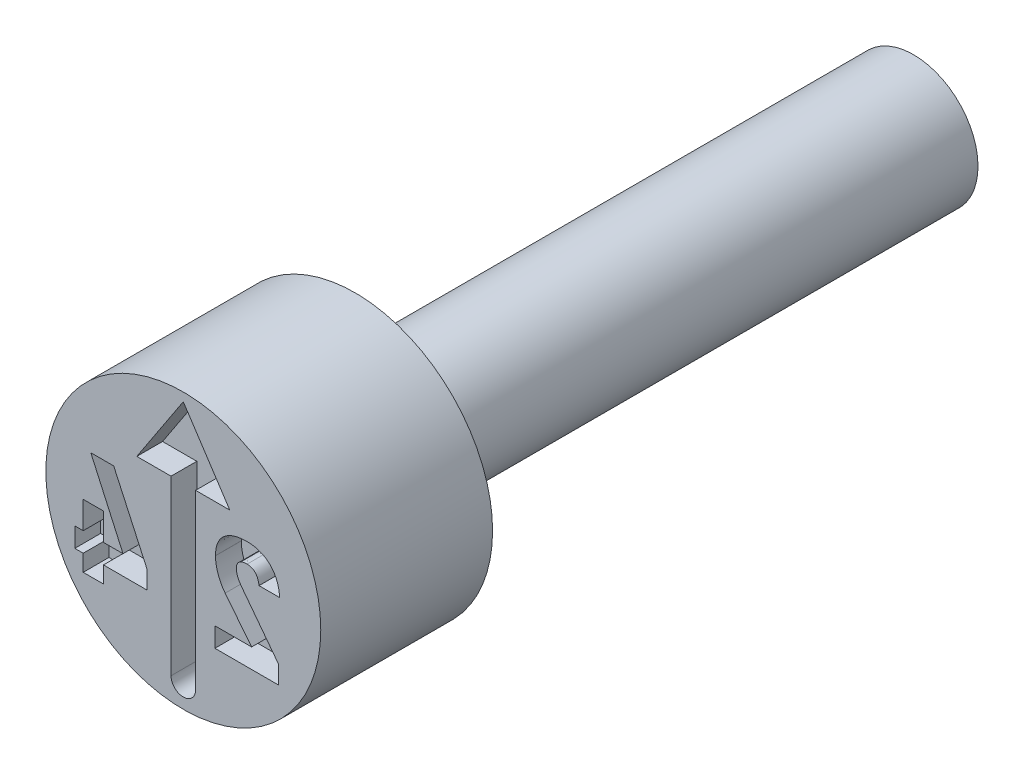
ISO-10303-21;
HEADER;
FILE_DESCRIPTION(('STEP AP214'),'2;1');
FILE_NAME('part.step','',(''),(''),'','','');
FILE_SCHEMA(('AUTOMOTIVE_DESIGN { 1 0 10303 214 1 1 1 1 }'));
ENDSEC;
DATA;
#1=APPLICATION_CONTEXT('core data for automotive mechanical design processes');
#2=APPLICATION_PROTOCOL_DEFINITION('international standard','automotive_design',2000,#1);
#3=PRODUCT_CONTEXT('',#1,'mechanical');
#4=PRODUCT('Part','Part','',(#3));
#5=PRODUCT_RELATED_PRODUCT_CATEGORY('part','',(#4));
#6=PRODUCT_DEFINITION_FORMATION('','',#4);
#7=PRODUCT_DEFINITION_CONTEXT('part definition',#1,'design');
#8=PRODUCT_DEFINITION('design','',#6,#7);
#9=PRODUCT_DEFINITION_SHAPE('','',#8);
#10=(LENGTH_UNIT() NAMED_UNIT(*) SI_UNIT(.MILLI.,.METRE.));
#11=(NAMED_UNIT(*) PLANE_ANGLE_UNIT() SI_UNIT($,.RADIAN.));
#12=(NAMED_UNIT(*) SI_UNIT($,.STERADIAN.) SOLID_ANGLE_UNIT());
#13=UNCERTAINTY_MEASURE_WITH_UNIT(LENGTH_MEASURE(1.E-05),#10,'distance_accuracy_value','');
#14=(GEOMETRIC_REPRESENTATION_CONTEXT(3) GLOBAL_UNCERTAINTY_ASSIGNED_CONTEXT((#13)) GLOBAL_UNIT_ASSIGNED_CONTEXT((#10,
#11,#12)) REPRESENTATION_CONTEXT('',''));
#15=CARTESIAN_POINT('',(0.,0.,0.));
#16=DIRECTION('',(0.,0.,1.));
#17=DIRECTION('',(1.,0.,0.));
#18=AXIS2_PLACEMENT_3D('',#15,#16,#17);
#19=CARTESIAN_POINT('',(0.,1.5,-4.));
#20=DIRECTION('',(0.,0.,1.));
#21=DIRECTION('',(1.,0.,0.));
#22=AXIS2_PLACEMENT_3D('',#19,#20,#21);
#23=PLANE('',#22);
#24=CARTESIAN_POINT('',(0.,0.,-4.));
#25=DIRECTION('',(0.,0.,1.));
#26=DIRECTION('',(1.,0.,0.));
#27=AXIS2_PLACEMENT_3D('',#24,#25,#26);
#28=CIRCLE('',#27,3.2);
#29=CARTESIAN_POINT('',(3.2,0.,-4.));
#30=VERTEX_POINT('',#29);
#31=EDGE_CURVE('E11',#30,#30,#28,.T.);
#32=ORIENTED_EDGE('',*,*,#31,.F.);
#33=EDGE_LOOP('',(#32));
#34=FACE_BOUND('',#33,.T.);
#35=CARTESIAN_POINT('',(0.,0.,-4.));
#36=DIRECTION('',(0.,0.,1.));
#37=DIRECTION('',(1.,0.,0.));
#38=AXIS2_PLACEMENT_3D('',#35,#36,#37);
#39=CIRCLE('',#38,1.5);
#40=CARTESIAN_POINT('',(1.5,0.,-4.));
#41=VERTEX_POINT('',#40);
#42=EDGE_CURVE('E444',#41,#41,#39,.T.);
#43=ORIENTED_EDGE('',*,*,#42,.T.);
#44=EDGE_LOOP('',(#43));
#45=FACE_BOUND('',#44,.T.);
#46=ADVANCED_FACE('F35',(#34,#45),#23,.F.);
#47=CARTESIAN_POINT('',(0.,0.,-0.403888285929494));
#48=DIRECTION('',(0.,0.,1.));
#49=DIRECTION('',(1.,0.,0.));
#50=AXIS2_PLACEMENT_3D('',#47,#48,#49);
#51=CYLINDRICAL_SURFACE('',#50,3.2);
#52=CARTESIAN_POINT('',(0.,0.,0.));
#53=DIRECTION('',(0.,0.,1.));
#54=DIRECTION('',(1.,0.,0.));
#55=AXIS2_PLACEMENT_3D('',#52,#53,#54);
#56=CIRCLE('',#55,3.2);
#57=CARTESIAN_POINT('',(3.2,0.,0.));
#58=VERTEX_POINT('',#57);
#59=EDGE_CURVE('E42',#58,#58,#56,.T.);
#60=ORIENTED_EDGE('',*,*,#59,.F.);
#61=EDGE_LOOP('',(#60));
#62=FACE_BOUND('',#61,.T.);
#63=ORIENTED_EDGE('',*,*,#31,.T.);
#64=EDGE_LOOP('',(#63));
#65=FACE_BOUND('',#64,.T.);
#66=ADVANCED_FACE('F429',(#62,#65),#51,.T.);
#67=CARTESIAN_POINT('',(0.,3.2,0.));
#68=DIRECTION('',(0.,0.,-1.));
#69=DIRECTION('',(-1.,0.,0.));
#70=AXIS2_PLACEMENT_3D('',#67,#68,#69);
#71=PLANE('',#70);
#72=DIRECTION('',(-0.60539313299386,0.795926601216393,0.));
#73=VECTOR('',#72,1.);
#74=CARTESIAN_POINT('',(2.21404116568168,-1.1750968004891,0.));
#75=LINE('',#74,#73);
#76=CARTESIAN_POINT('',(2.21404116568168,-1.1750968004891,0.));
#77=VERTEX_POINT('',#76);
#78=CARTESIAN_POINT('',(1.35608314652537,-0.0471163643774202,0.));
#79=VERTEX_POINT('',#78);
#80=EDGE_CURVE('E709',#77,#79,#75,.T.);
#81=ORIENTED_EDGE('',*,*,#80,.F.);
#82=DIRECTION('',(0.,1.,0.));
#83=VECTOR('',#82,1.);
#84=CARTESIAN_POINT('',(2.21404116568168,-1.6,0.));
#85=LINE('',#84,#83);
#86=CARTESIAN_POINT('',(2.21404116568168,-1.6,0.));
#87=VERTEX_POINT('',#86);
#88=EDGE_CURVE('E49',#87,#77,#85,.T.);
#89=ORIENTED_EDGE('',*,*,#88,.F.);
#90=DIRECTION('',(1.,0.,0.));
#91=VECTOR('',#90,1.);
#92=CARTESIAN_POINT('',(0.735541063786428,-1.6,0.));
#93=LINE('',#92,#91);
#94=CARTESIAN_POINT('',(0.735541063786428,-1.6,0.));
#95=VERTEX_POINT('',#94);
#96=EDGE_CURVE('E308',#95,#87,#93,.T.);
#97=ORIENTED_EDGE('',*,*,#96,.F.);
#98=DIRECTION('',(0.,-1.,0.));
#99=VECTOR('',#98,1.);
#100=CARTESIAN_POINT('',(0.735541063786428,-1.14605665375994,0.));
#101=LINE('',#100,#99);
#102=CARTESIAN_POINT('',(0.735541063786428,-1.14605665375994,0.));
#103=VERTEX_POINT('',#102);
#104=EDGE_CURVE('E311',#103,#95,#101,.T.);
#105=ORIENTED_EDGE('',*,*,#104,.F.);
#106=DIRECTION('',(-1.,0.,0.));
#107=VECTOR('',#106,1.);
#108=CARTESIAN_POINT('',(1.58993274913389,-1.14605665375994,0.));
#109=LINE('',#108,#107);
#110=CARTESIAN_POINT('',(1.58993274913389,-1.14605665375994,0.));
#111=VERTEX_POINT('',#110);
#112=EDGE_CURVE('E643',#111,#103,#109,.T.);
#113=ORIENTED_EDGE('',*,*,#112,.F.);
#114=DIRECTION('',(0.620676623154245,-0.78406666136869,0.));
#115=VECTOR('',#114,1.);
#116=CARTESIAN_POINT('',(0.97448542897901,-0.368595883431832,0.));
#117=LINE('',#116,#115);
#118=CARTESIAN_POINT('',(0.97448542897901,-0.368595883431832,0.));
#119=VERTEX_POINT('',#118);
#120=EDGE_CURVE('E646',#119,#111,#117,.T.);
#121=ORIENTED_EDGE('',*,*,#120,.F.);
#122=CARTESIAN_POINT('',(0.7492969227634,0.272325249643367,0.));
#123=CARTESIAN_POINT('',(0.749950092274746,0.243928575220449,0.));
#124=CARTESIAN_POINT('',(0.751257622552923,0.187083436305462,0.));
#125=CARTESIAN_POINT('',(0.762919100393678,0.102158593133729,0.));
#126=CARTESIAN_POINT('',(0.781987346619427,0.0177244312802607,0.));
#127=CARTESIAN_POINT('',(0.807860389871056,-0.0659231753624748,0.));
#128=CARTESIAN_POINT('',(0.840168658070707,-0.147387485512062,0.));
#129=CARTESIAN_POINT('',(0.878726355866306,-0.225370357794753,0.));
#130=CARTESIAN_POINT('',(0.922747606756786,-0.299672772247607,0.));
#131=CARTESIAN_POINT('',(0.957241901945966,-0.345624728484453,0.));
#132=CARTESIAN_POINT('',(0.97448542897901,-0.368595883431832,0.));
#133=B_SPLINE_CURVE_WITH_KNOTS('',3,(#122,#123,#124,#125,#126,#127,#128,#129,#130,#131,#132),
.UNSPECIFIED.,.F.,.F.,(4,1,1,1,1,1,1,1,4),(0.,0.123148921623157,0.24652244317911,
0.371108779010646,0.498350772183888,0.625999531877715,0.750879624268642,0.875465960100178,1.),.UNSPECIFIED.);
#134=CARTESIAN_POINT('',(0.7492969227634,0.272325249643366,0.));
#135=VERTEX_POINT('',#134);
#136=EDGE_CURVE('E649',#135,#119,#133,.T.);
#137=ORIENTED_EDGE('',*,*,#136,.F.);
#138=DIRECTION('',(0.,-1.,0.));
#139=VECTOR('',#138,1.);
#140=CARTESIAN_POINT('',(0.7492969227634,0.274363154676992,0.));
#141=LINE('',#140,#139);
#142=CARTESIAN_POINT('',(0.7492969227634,0.274363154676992,0.));
#143=VERTEX_POINT('',#142);
#144=EDGE_CURVE('E654',#143,#135,#141,.T.);
#145=ORIENTED_EDGE('',*,*,#144,.F.);
#146=CARTESIAN_POINT('',(1.48854697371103,0.925983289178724,0.));
#147=CARTESIAN_POINT('',(1.45096878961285,0.925197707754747,0.));
#148=CARTESIAN_POINT('',(1.37823850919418,0.923677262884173,0.));
#149=CARTESIAN_POINT('',(1.27351179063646,0.909364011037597,0.));
#150=CARTESIAN_POINT('',(1.17721376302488,0.885545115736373,0.));
#151=CARTESIAN_POINT('',(1.08958601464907,0.8520805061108,0.));
#152=CARTESIAN_POINT('',(1.0112039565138,0.809062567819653,0.));
#153=CARTESIAN_POINT('',(0.941704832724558,0.758000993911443,0.));
#154=CARTESIAN_POINT('',(0.883050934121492,0.696913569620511,0.));
#155=CARTESIAN_POINT('',(0.83426247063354,0.627517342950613,0.));
#156=CARTESIAN_POINT('',(0.795802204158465,0.550080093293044,0.));
#157=CARTESIAN_POINT('',(0.768868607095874,0.464668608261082,0.));
#158=CARTESIAN_POINT('',(0.752374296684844,0.37196896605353,0.));
#159=CARTESIAN_POINT('',(0.750343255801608,0.307549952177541,0.));
#160=CARTESIAN_POINT('',(0.7492969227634,0.274363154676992,0.));
#161=B_SPLINE_CURVE_WITH_KNOTS('',3,(#146,#147,#148,#149,#150,#151,#152,#153,#154,#155,#156,
#157,#158,#159,#160),.UNSPECIFIED.,.F.,.F.,(4,1,1,1,1,1,1,1,1,1,1,1,4),(0.,0.100715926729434,
0.194929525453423,0.2827284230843,0.366191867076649,0.44566981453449,0.521804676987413,
0.596515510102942,0.671682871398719,0.748455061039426,0.827368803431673,0.911065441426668,1.),.UNSPECIFIED.);
#162=CARTESIAN_POINT('',(1.48854697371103,0.925983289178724,0.));
#163=VERTEX_POINT('',#162);
#164=EDGE_CURVE('E660',#163,#143,#161,.T.);
#165=ORIENTED_EDGE('',*,*,#164,.F.);
#166=CARTESIAN_POINT('',(2.24511921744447,0.17807214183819,0.));
#167=CARTESIAN_POINT('',(2.24165858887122,0.215709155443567,0.));
#168=CARTESIAN_POINT('',(2.23491707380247,0.289028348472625,0.));
#169=CARTESIAN_POINT('',(2.21199401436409,0.394467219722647,0.));
#170=CARTESIAN_POINT('',(2.17813000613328,0.491486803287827,0.));
#171=CARTESIAN_POINT('',(2.13486403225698,0.580354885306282,0.));
#172=CARTESIAN_POINT('',(2.08181240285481,0.659949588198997,0.));
#173=CARTESIAN_POINT('',(2.02025672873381,0.730249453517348,0.));
#174=CARTESIAN_POINT('',(1.9495152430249,0.789888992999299,0.));
#175=CARTESIAN_POINT('',(1.87081328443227,0.839447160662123,0.));
#176=CARTESIAN_POINT('',(1.78449460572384,0.878231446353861,0.));
#177=CARTESIAN_POINT('',(1.69161484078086,0.906490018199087,0.));
#178=CARTESIAN_POINT('',(1.59203410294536,0.922780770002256,0.));
#179=CARTESIAN_POINT('',(1.52359035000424,0.924898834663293,0.));
#180=CARTESIAN_POINT('',(1.48854697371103,0.925983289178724,0.));
#181=B_SPLINE_CURVE_WITH_KNOTS('',3,(#166,#167,#168,#169,#170,#171,#172,#173,#174,#175,#176,
#177,#178,#179,#180),.UNSPECIFIED.,.F.,.F.,(4,1,1,1,1,1,1,1,1,1,1,1,4),(0.,0.0953291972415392,
0.185707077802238,0.271513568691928,0.35413169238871,0.434493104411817,0.512233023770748,
0.58917600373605,0.667186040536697,0.746219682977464,0.827302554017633,0.911578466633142,1.),.UNSPECIFIED.);
#182=CARTESIAN_POINT('',(2.24511921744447,0.17807214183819,0.));
#183=VERTEX_POINT('',#182);
#184=EDGE_CURVE('E665',#183,#163,#181,.T.);
#185=ORIENTED_EDGE('',*,*,#184,.F.);
#186=DIRECTION('',(0.,1.,0.));
#187=VECTOR('',#186,1.);
#188=CARTESIAN_POINT('',(2.24511921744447,0.176034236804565,0.));
#189=LINE('',#188,#187);
#190=CARTESIAN_POINT('',(2.24511921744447,0.176034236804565,0.));
#191=VERTEX_POINT('',#190);
#192=EDGE_CURVE('E673',#191,#183,#189,.T.);
#193=ORIENTED_EDGE('',*,*,#192,.F.);
#194=DIRECTION('',(1.,0.,0.));
#195=VECTOR('',#194,1.);
#196=CARTESIAN_POINT('',(1.76213572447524,0.176034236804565,0.));
#197=LINE('',#196,#195);
#198=CARTESIAN_POINT('',(1.76213572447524,0.176034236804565,0.));
#199=VERTEX_POINT('',#198);
#200=EDGE_CURVE('E679',#199,#191,#197,.T.);
#201=ORIENTED_EDGE('',*,*,#200,.F.);
#202=DIRECTION('',(0.,-1.,0.));
#203=VECTOR('',#202,1.);
#204=CARTESIAN_POINT('',(1.76213572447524,0.17807214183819,0.));
#205=LINE('',#204,#203);
#206=CARTESIAN_POINT('',(1.76213572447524,0.17807214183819,0.));
#207=VERTEX_POINT('',#206);
#208=EDGE_CURVE('E682',#207,#199,#205,.T.);
#209=ORIENTED_EDGE('',*,*,#208,.F.);
#210=CARTESIAN_POINT('',(1.48498063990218,0.472039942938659,0.));
#211=CARTESIAN_POINT('',(1.50358615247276,0.471254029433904,0.));
#212=CARTESIAN_POINT('',(1.53969356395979,0.469728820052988,0.));
#213=CARTESIAN_POINT('',(1.59105662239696,0.455195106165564,0.));
#214=CARTESIAN_POINT('',(1.63668416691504,0.430521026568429,0.));
#215=CARTESIAN_POINT('',(1.67618218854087,0.396420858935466,0.));
#216=CARTESIAN_POINT('',(1.70932460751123,0.353522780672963,0.));
#217=CARTESIAN_POINT('',(1.73375303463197,0.301844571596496,0.));
#218=CARTESIAN_POINT('',(1.75342564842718,0.243110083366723,0.));
#219=CARTESIAN_POINT('',(1.75913461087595,0.200481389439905,0.));
#220=CARTESIAN_POINT('',(1.76213572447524,0.17807214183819,0.));
#221=B_SPLINE_CURVE_WITH_KNOTS('',3,(#210,#211,#212,#213,#214,#215,#216,#217,#218,#219,#220),
.UNSPECIFIED.,.F.,.F.,(4,1,1,1,1,1,1,1,4),(0.,0.124212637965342,0.241057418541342,
0.353359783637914,0.468536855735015,0.587568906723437,0.713021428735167,0.849139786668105,1.),.UNSPECIFIED.);
#222=CARTESIAN_POINT('',(1.48498063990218,0.472039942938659,0.));
#223=VERTEX_POINT('',#222);
#224=EDGE_CURVE('E685',#223,#207,#221,.T.);
#225=ORIENTED_EDGE('',*,*,#224,.F.);
#226=CARTESIAN_POINT('',(1.23431832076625,0.26060729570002,0.));
#227=CARTESIAN_POINT('',(1.23500205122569,0.276660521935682,0.));
#228=CARTESIAN_POINT('',(1.23630501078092,0.307252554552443,0.));
#229=CARTESIAN_POINT('',(1.24888390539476,0.350292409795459,0.));
#230=CARTESIAN_POINT('',(1.26968441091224,0.387510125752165,0.));
#231=CARTESIAN_POINT('',(1.29882028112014,0.418709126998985,0.));
#232=CARTESIAN_POINT('',(1.33588128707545,0.442687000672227,0.));
#233=CARTESIAN_POINT('',(1.37959709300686,0.460202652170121,0.));
#234=CARTESIAN_POINT('',(1.43020001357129,0.470113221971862,0.));
#235=CARTESIAN_POINT('',(1.46608617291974,0.471375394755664,0.));
#236=CARTESIAN_POINT('',(1.48498063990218,0.472039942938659,0.));
#237=B_SPLINE_CURVE_WITH_KNOTS('',3,(#226,#227,#228,#229,#230,#231,#232,#233,#234,#235,#236),
.UNSPECIFIED.,.F.,.F.,(4,1,1,1,1,1,1,1,4),(0.,0.129170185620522,0.246154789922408,
0.35773418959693,0.470108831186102,0.586692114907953,0.710769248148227,0.847716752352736,1.),.UNSPECIFIED.);
#238=CARTESIAN_POINT('',(1.23431832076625,0.26060729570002,0.));
#239=VERTEX_POINT('',#238);
#240=EDGE_CURVE('E690',#239,#223,#237,.T.);
#241=ORIENTED_EDGE('',*,*,#240,.F.);
#242=DIRECTION('',(0.,1.,0.));
#243=VECTOR('',#242,1.);
#244=CARTESIAN_POINT('',(1.23431832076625,0.257040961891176,0.));
#245=LINE('',#244,#243);
#246=CARTESIAN_POINT('',(1.23431832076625,0.257040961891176,0.));
#247=VERTEX_POINT('',#246);
#248=EDGE_CURVE('E698',#247,#239,#245,.T.);
#249=ORIENTED_EDGE('',*,*,#248,.F.);
#250=CARTESIAN_POINT('',(1.35608314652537,-0.0471163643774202,0.));
#251=CARTESIAN_POINT('',(1.33808943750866,-0.0221517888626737,0.));
#252=CARTESIAN_POINT('',(1.3029619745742,0.0265842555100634,0.));
#253=CARTESIAN_POINT('',(1.27153375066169,0.0938048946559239,0.));
#254=CARTESIAN_POINT('',(1.25156842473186,0.146512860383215,0.));
#255=CARTESIAN_POINT('',(1.24233803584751,0.184746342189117,0.));
#256=CARTESIAN_POINT('',(1.23550499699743,0.22130617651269,0.));
#257=CARTESIAN_POINT('',(1.23470843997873,0.245293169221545,0.));
#258=CARTESIAN_POINT('',(1.23431832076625,0.257040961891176,0.));
#259=B_SPLINE_CURVE_WITH_KNOTS('',3,(#250,#251,#252,#253,#254,#255,#256,#257,#258),
.UNSPECIFIED.,.F.,.F.,(4,1,1,1,1,1,4),(0.,0.27673722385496,0.540248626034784,0.66563356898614,
0.784034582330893,0.894229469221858,1.),.UNSPECIFIED.);
#260=EDGE_CURVE('E704',#79,#247,#259,.T.);
#261=ORIENTED_EDGE('',*,*,#260,.F.);
#262=EDGE_LOOP('',(#81,#89,#97,#105,#113,#121,#137,#145,#165,#185,#193,#201,#209,#225,#241,#249,#261));
#263=FACE_BOUND('',#262,.T.);
#264=DIRECTION('',(0.,-1.,0.));
#265=VECTOR('',#264,1.);
#266=CARTESIAN_POINT('',(-2.33032402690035,-0.12965151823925,0.));
#267=LINE('',#266,#265);
#268=CARTESIAN_POINT('',(-2.33032402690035,-0.12965151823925,0.));
#269=VERTEX_POINT('',#268);
#270=CARTESIAN_POINT('',(-2.33032402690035,-0.762421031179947,0.));
#271=VERTEX_POINT('',#270);
#272=EDGE_CURVE('E592',#269,#271,#267,.T.);
#273=ORIENTED_EDGE('',*,*,#272,.F.);
#274=DIRECTION('',(-1.,0.,0.));
#275=VECTOR('',#274,1.);
#276=CARTESIAN_POINT('',(-1.85905848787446,-0.12965151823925,0.));
#277=LINE('',#276,#275);
#278=CARTESIAN_POINT('',(-1.85905848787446,-0.12965151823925,0.));
#279=VERTEX_POINT('',#278);
#280=EDGE_CURVE('E595',#279,#269,#277,.T.);
#281=ORIENTED_EDGE('',*,*,#280,.F.);
#282=DIRECTION('',(0.,1.,0.));
#283=VECTOR('',#282,1.);
#284=CARTESIAN_POINT('',(-1.85905848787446,-1.60152842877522,0.));
#285=LINE('',#284,#283);
#286=CARTESIAN_POINT('',(-1.85905848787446,-0.762421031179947,0.));
#287=VERTEX_POINT('',#286);
#288=EDGE_CURVE('E600',#287,#279,#285,.T.);
#289=ORIENTED_EDGE('',*,*,#288,.F.);
#290=DIRECTION('',(-1.,0.,0.));
#291=VECTOR('',#290,1.);
#292=CARTESIAN_POINT('',(-1.40358671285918,-0.762421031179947,0.));
#293=LINE('',#292,#291);
#294=CARTESIAN_POINT('',(-1.40358671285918,-0.762421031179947,0.));
#295=VERTEX_POINT('',#294);
#296=EDGE_CURVE('E533',#295,#287,#293,.T.);
#297=ORIENTED_EDGE('',*,*,#296,.F.);
#298=DIRECTION('',(0.411526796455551,-0.911397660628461,0.));
#299=VECTOR('',#298,1.);
#300=CARTESIAN_POINT('',(-2.15353576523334,0.898471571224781,0.));
#301=LINE('',#300,#299);
#302=CARTESIAN_POINT('',(-2.15353576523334,0.898471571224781,0.));
#303=VERTEX_POINT('',#302);
#304=EDGE_CURVE('E537',#303,#295,#301,.T.);
#305=ORIENTED_EDGE('',*,*,#304,.F.);
#306=DIRECTION('',(-1.,0.,0.));
#307=VECTOR('',#306,1.);
#308=CARTESIAN_POINT('',(-1.62011412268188,0.898471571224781,0.));
#309=LINE('',#308,#307);
#310=CARTESIAN_POINT('',(-1.62011412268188,0.898471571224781,0.));
#311=VERTEX_POINT('',#310);
#312=EDGE_CURVE('E540',#311,#303,#309,.T.);
#313=ORIENTED_EDGE('',*,*,#312,.F.);
#314=DIRECTION('',(-0.416436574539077,0.909164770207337,0.));
#315=VECTOR('',#314,1.);
#316=CARTESIAN_POINT('',(-0.849786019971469,-0.783309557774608,0.));
#317=LINE('',#316,#315);
#318=CARTESIAN_POINT('',(-0.849786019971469,-0.783309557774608,0.));
#319=VERTEX_POINT('',#318);
#320=EDGE_CURVE('E543',#319,#311,#317,.T.);
#321=ORIENTED_EDGE('',*,*,#320,.F.);
#322=DIRECTION('',(0.,1.,0.));
#323=VECTOR('',#322,1.);
#324=CARTESIAN_POINT('',(-0.849786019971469,-1.21636437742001,0.));
#325=LINE('',#324,#323);
#326=CARTESIAN_POINT('',(-0.849786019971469,-1.21636437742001,0.));
#327=VERTEX_POINT('',#326);
#328=EDGE_CURVE('E546',#327,#319,#325,.T.);
#329=ORIENTED_EDGE('',*,*,#328,.F.);
#330=DIRECTION('',(1.,0.,0.));
#331=VECTOR('',#330,1.);
#332=CARTESIAN_POINT('',(-2.52647238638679,-1.21636437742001,0.));
#333=LINE('',#332,#331);
#334=CARTESIAN_POINT('',(-1.85905848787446,-1.21636437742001,0.));
#335=VERTEX_POINT('',#334);
#336=EDGE_CURVE('E529',#335,#327,#333,.T.);
#337=ORIENTED_EDGE('',*,*,#336,.F.);
#338=CARTESIAN_POINT('',(-1.85905848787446,-1.60152842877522,0.));
#339=VERTEX_POINT('',#338);
#340=EDGE_CURVE('E598',#339,#335,#285,.T.);
#341=ORIENTED_EDGE('',*,*,#340,.F.);
#342=DIRECTION('',(1.,0.,0.));
#343=VECTOR('',#342,1.);
#344=CARTESIAN_POINT('',(-2.33032402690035,-1.60152842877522,0.));
#345=LINE('',#344,#343);
#346=CARTESIAN_POINT('',(-2.33032402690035,-1.60152842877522,0.));
#347=VERTEX_POINT('',#346);
#348=EDGE_CURVE('E589',#347,#339,#345,.T.);
#349=ORIENTED_EDGE('',*,*,#348,.F.);
#350=CARTESIAN_POINT('',(-2.33032402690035,-1.21636437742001,0.));
#351=VERTEX_POINT('',#350);
#352=EDGE_CURVE('E594',#351,#347,#267,.T.);
#353=ORIENTED_EDGE('',*,*,#352,.F.);
#354=CARTESIAN_POINT('',(-2.52647238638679,-1.21636437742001,0.));
#355=VERTEX_POINT('',#354);
#356=EDGE_CURVE('E525',#355,#351,#333,.T.);
#357=ORIENTED_EDGE('',*,*,#356,.F.);
#358=DIRECTION('',(0.,-1.,0.));
#359=VECTOR('',#358,1.);
#360=CARTESIAN_POINT('',(-2.52647238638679,-0.762421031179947,0.));
#361=LINE('',#360,#359);
#362=CARTESIAN_POINT('',(-2.52647238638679,-0.762421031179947,0.));
#363=VERTEX_POINT('',#362);
#364=EDGE_CURVE('E530',#363,#355,#361,.T.);
#365=ORIENTED_EDGE('',*,*,#364,.F.);
#366=EDGE_CURVE('E536',#271,#363,#293,.T.);
#367=ORIENTED_EDGE('',*,*,#366,.F.);
#368=EDGE_LOOP('',(#273,#281,#289,#297,#305,#313,#321,#329,#337,#341,#349,#353,#357,#365,#367));
#369=FACE_BOUND('',#368,.T.);
#370=DIRECTION('',(0.,1.,0.));
#371=VECTOR('',#370,1.);
#372=CARTESIAN_POINT('',(0.28570968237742,1.35952714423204,0.));
#373=LINE('',#372,#371);
#374=CARTESIAN_POINT('',(0.285709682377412,-2.66424275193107,0.));
#375=VERTEX_POINT('',#374);
#376=CARTESIAN_POINT('',(0.28570968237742,1.35952714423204,0.));
#377=VERTEX_POINT('',#376);
#378=EDGE_CURVE('E483',#375,#377,#373,.T.);
#379=ORIENTED_EDGE('',*,*,#378,.F.);
#380=CARTESIAN_POINT('',(2.4513673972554E-13,-2.66424275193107,0.));
#381=DIRECTION('',(0.,0.,1.));
#382=DIRECTION('',(1.,0.,0.));
#383=AXIS2_PLACEMENT_3D('',#380,#381,#382);
#384=CIRCLE('',#383,0.285709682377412);
#385=CARTESIAN_POINT('',(-0.285709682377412,-2.66424275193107,0.));
#386=VERTEX_POINT('',#385);
#387=EDGE_CURVE('E486',#386,#375,#384,.T.);
#388=ORIENTED_EDGE('',*,*,#387,.F.);
#389=DIRECTION('',(0.,-1.,0.));
#390=VECTOR('',#389,1.);
#391=CARTESIAN_POINT('',(-0.28570968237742,1.35952714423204,0.));
#392=LINE('',#391,#390);
#393=CARTESIAN_POINT('',(-0.28570968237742,1.35952714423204,0.));
#394=VERTEX_POINT('',#393);
#395=EDGE_CURVE('E467',#394,#386,#392,.T.);
#396=ORIENTED_EDGE('',*,*,#395,.F.);
#397=DIRECTION('',(1.,0.,0.));
#398=VECTOR('',#397,1.);
#399=CARTESIAN_POINT('',(-1.08287651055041,1.35952714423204,0.));
#400=LINE('',#399,#398);
#401=CARTESIAN_POINT('',(-1.08287651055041,1.35952714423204,0.));
#402=VERTEX_POINT('',#401);
#403=EDGE_CURVE('E471',#402,#394,#400,.T.);
#404=ORIENTED_EDGE('',*,*,#403,.F.);
#405=DIRECTION('',(-0.550159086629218,-0.835059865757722,0.));
#406=VECTOR('',#405,1.);
#407=CARTESIAN_POINT('',(0.,3.00317301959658,0.));
#408=LINE('',#407,#406);
#409=CARTESIAN_POINT('',(0.,3.00317301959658,0.));
#410=VERTEX_POINT('',#409);
#411=EDGE_CURVE('E474',#410,#402,#408,.T.);
#412=ORIENTED_EDGE('',*,*,#411,.F.);
#413=DIRECTION('',(-0.550159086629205,0.835059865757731,0.));
#414=VECTOR('',#413,1.);
#415=CARTESIAN_POINT('',(0.,3.00317301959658,0.));
#416=LINE('',#415,#414);
#417=CARTESIAN_POINT('',(1.08287651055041,1.35952714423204,0.));
#418=VERTEX_POINT('',#417);
#419=EDGE_CURVE('E477',#418,#410,#416,.T.);
#420=ORIENTED_EDGE('',*,*,#419,.F.);
#421=DIRECTION('',(1.,0.,0.));
#422=VECTOR('',#421,1.);
#423=CARTESIAN_POINT('',(1.08287651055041,1.35952714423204,0.));
#424=LINE('',#423,#422);
#425=EDGE_CURVE('E480',#377,#418,#424,.T.);
#426=ORIENTED_EDGE('',*,*,#425,.F.);
#427=EDGE_LOOP('',(#379,#388,#396,#404,#412,#420,#426));
#428=FACE_BOUND('',#427,.T.);
#429=ORIENTED_EDGE('',*,*,#59,.T.);
#430=EDGE_LOOP('',(#429));
#431=FACE_BOUND('',#430,.T.);
#432=ADVANCED_FACE('F426',(#263,#369,#428,#431),#71,.F.);
#433=CARTESIAN_POINT('',(0.,0.,-17.));
#434=DIRECTION('',(0.,0.,1.));
#435=DIRECTION('',(1.,0.,0.));
#436=AXIS2_PLACEMENT_3D('',#433,#434,#435);
#437=PLANE('',#436);
#438=CARTESIAN_POINT('',(0.,0.,-17.));
#439=DIRECTION('',(0.,0.,1.));
#440=DIRECTION('',(1.,0.,0.));
#441=AXIS2_PLACEMENT_3D('',#438,#439,#440);
#442=CIRCLE('',#441,1.5);
#443=CARTESIAN_POINT('',(1.5,0.,-17.));
#444=VERTEX_POINT('',#443);
#445=EDGE_CURVE('E445',#444,#444,#442,.T.);
#446=ORIENTED_EDGE('',*,*,#445,.F.);
#447=EDGE_LOOP('',(#446));
#448=FACE_BOUND('',#447,.T.);
#449=ADVANCED_FACE('F422',(#448),#437,.F.);
#450=CARTESIAN_POINT('',(0.,0.,-0.403888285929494));
#451=DIRECTION('',(0.,0.,1.));
#452=DIRECTION('',(1.,0.,0.));
#453=AXIS2_PLACEMENT_3D('',#450,#451,#452);
#454=CYLINDRICAL_SURFACE('',#453,1.5);
#455=ORIENTED_EDGE('',*,*,#42,.F.);
#456=EDGE_LOOP('',(#455));
#457=FACE_BOUND('',#456,.T.);
#458=ORIENTED_EDGE('',*,*,#445,.T.);
#459=EDGE_LOOP('',(#458));
#460=FACE_BOUND('',#459,.T.);
#461=ADVANCED_FACE('F418',(#457,#460),#454,.T.);
#462=CARTESIAN_POINT('',(2.4513673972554E-13,-2.66424275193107,-0.6));
#463=DIRECTION('',(0.,0.,1.));
#464=DIRECTION('',(1.,0.,0.));
#465=AXIS2_PLACEMENT_3D('',#462,#463,#464);
#466=CYLINDRICAL_SURFACE('',#465,0.285709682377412);
#467=ORIENTED_EDGE('',*,*,#387,.T.);
#468=DIRECTION('',(0.,0.,1.));
#469=VECTOR('',#468,1.);
#470=CARTESIAN_POINT('',(0.285709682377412,-2.66424275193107,-0.6));
#471=LINE('',#470,#469);
#472=CARTESIAN_POINT('',(0.285709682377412,-2.66424275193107,-0.6));
#473=VERTEX_POINT('',#472);
#474=EDGE_CURVE('E453',#473,#375,#471,.T.);
#475=ORIENTED_EDGE('',*,*,#474,.F.);
#476=CARTESIAN_POINT('',(2.4513673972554E-13,-2.66424275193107,-0.6));
#477=DIRECTION('',(0.,0.,1.));
#478=DIRECTION('',(1.,0.,0.));
#479=AXIS2_PLACEMENT_3D('',#476,#477,#478);
#480=CIRCLE('',#479,0.285709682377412);
#481=CARTESIAN_POINT('',(-0.285709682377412,-2.66424275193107,-0.6));
#482=VERTEX_POINT('',#481);
#483=EDGE_CURVE('E470',#482,#473,#480,.T.);
#484=ORIENTED_EDGE('',*,*,#483,.F.);
#485=DIRECTION('',(0.,0.,1.));
#486=VECTOR('',#485,1.);
#487=CARTESIAN_POINT('',(-0.285709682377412,-2.66424275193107,-0.6));
#488=LINE('',#487,#486);
#489=EDGE_CURVE('E446',#482,#386,#488,.T.);
#490=ORIENTED_EDGE('',*,*,#489,.T.);
#491=EDGE_LOOP('',(#467,#475,#484,#490));
#492=FACE_BOUND('',#491,.T.);
#493=ADVANCED_FACE('F396',(#492),#466,.F.);
#494=CARTESIAN_POINT('',(-0.28570968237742,1.35952714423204,-0.6));
#495=DIRECTION('',(-1.,0.,0.));
#496=DIRECTION('',(0.,-1.,0.));
#497=AXIS2_PLACEMENT_3D('',#494,#495,#496);
#498=PLANE('',#497);
#499=ORIENTED_EDGE('',*,*,#395,.T.);
#500=ORIENTED_EDGE('',*,*,#489,.F.);
#501=DIRECTION('',(0.,-1.,0.));
#502=VECTOR('',#501,1.);
#503=CARTESIAN_POINT('',(-0.28570968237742,1.35952714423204,-0.6));
#504=LINE('',#503,#502);
#505=CARTESIAN_POINT('',(-0.28570968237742,1.35952714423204,-0.6));
#506=VERTEX_POINT('',#505);
#507=EDGE_CURVE('E458',#506,#482,#504,.T.);
#508=ORIENTED_EDGE('',*,*,#507,.F.);
#509=DIRECTION('',(0.,0.,1.));
#510=VECTOR('',#509,1.);
#511=CARTESIAN_POINT('',(-0.28570968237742,1.35952714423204,-0.6));
#512=LINE('',#511,#510);
#513=EDGE_CURVE('E450',#506,#394,#512,.T.);
#514=ORIENTED_EDGE('',*,*,#513,.T.);
#515=EDGE_LOOP('',(#499,#500,#508,#514));
#516=FACE_BOUND('',#515,.T.);
#517=ADVANCED_FACE('F392',(#516),#498,.F.);
#518=CARTESIAN_POINT('',(-1.08287651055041,1.35952714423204,-0.6));
#519=DIRECTION('',(0.,-1.,0.));
#520=DIRECTION('',(0.,0.,-1.));
#521=AXIS2_PLACEMENT_3D('',#518,#519,#520);
#522=PLANE('',#521);
#523=ORIENTED_EDGE('',*,*,#403,.T.);
#524=ORIENTED_EDGE('',*,*,#513,.F.);
#525=DIRECTION('',(1.,0.,0.));
#526=VECTOR('',#525,1.);
#527=CARTESIAN_POINT('',(-1.08287651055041,1.35952714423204,-0.6));
#528=LINE('',#527,#526);
#529=CARTESIAN_POINT('',(-1.08287651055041,1.35952714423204,-0.6));
#530=VERTEX_POINT('',#529);
#531=EDGE_CURVE('E491',#530,#506,#528,.T.);
#532=ORIENTED_EDGE('',*,*,#531,.F.);
#533=DIRECTION('',(0.,0.,1.));
#534=VECTOR('',#533,1.);
#535=CARTESIAN_POINT('',(-1.08287651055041,1.35952714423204,-0.6));
#536=LINE('',#535,#534);
#537=EDGE_CURVE('E464',#530,#402,#536,.T.);
#538=ORIENTED_EDGE('',*,*,#537,.T.);
#539=EDGE_LOOP('',(#523,#524,#532,#538));
#540=FACE_BOUND('',#539,.T.);
#541=ADVANCED_FACE('F395',(#540),#522,.F.);
#542=CARTESIAN_POINT('',(0.,3.00317301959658,-0.6));
#543=DIRECTION('',(-0.835059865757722,0.550159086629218,0.));
#544=DIRECTION('',(-0.550159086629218,-0.835059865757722,0.));
#545=AXIS2_PLACEMENT_3D('',#542,#543,#544);
#546=PLANE('',#545);
#547=ORIENTED_EDGE('',*,*,#411,.T.);
#548=ORIENTED_EDGE('',*,*,#537,.F.);
#549=DIRECTION('',(-0.550159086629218,-0.835059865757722,0.));
#550=VECTOR('',#549,1.);
#551=CARTESIAN_POINT('',(0.,3.00317301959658,-0.6));
#552=LINE('',#551,#550);
#553=CARTESIAN_POINT('',(0.,3.00317301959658,-0.6));
#554=VERTEX_POINT('',#553);
#555=EDGE_CURVE('E494',#554,#530,#552,.T.);
#556=ORIENTED_EDGE('',*,*,#555,.F.);
#557=DIRECTION('',(0.,0.,1.));
#558=VECTOR('',#557,1.);
#559=CARTESIAN_POINT('',(0.,3.00317301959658,-0.6));
#560=LINE('',#559,#558);
#561=EDGE_CURVE('E462',#554,#410,#560,.T.);
#562=ORIENTED_EDGE('',*,*,#561,.T.);
#563=EDGE_LOOP('',(#547,#548,#556,#562));
#564=FACE_BOUND('',#563,.T.);
#565=ADVANCED_FACE('F400',(#564),#546,.F.);
#566=CARTESIAN_POINT('',(0.,3.00317301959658,-0.6));
#567=DIRECTION('',(0.835059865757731,0.550159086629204,0.));
#568=DIRECTION('',(-0.550159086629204,0.835059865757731,0.));
#569=AXIS2_PLACEMENT_3D('',#566,#567,#568);
#570=PLANE('',#569);
#571=ORIENTED_EDGE('',*,*,#419,.T.);
#572=ORIENTED_EDGE('',*,*,#561,.F.);
#573=DIRECTION('',(-0.550159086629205,0.835059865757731,0.));
#574=VECTOR('',#573,1.);
#575=CARTESIAN_POINT('',(0.,3.00317301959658,-0.6));
#576=LINE('',#575,#574);
#577=CARTESIAN_POINT('',(1.08287651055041,1.35952714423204,-0.6));
#578=VERTEX_POINT('',#577);
#579=EDGE_CURVE('E497',#578,#554,#576,.T.);
#580=ORIENTED_EDGE('',*,*,#579,.F.);
#581=DIRECTION('',(0.,0.,1.));
#582=VECTOR('',#581,1.);
#583=CARTESIAN_POINT('',(1.08287651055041,1.35952714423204,-0.6));
#584=LINE('',#583,#582);
#585=EDGE_CURVE('E460',#578,#418,#584,.T.);
#586=ORIENTED_EDGE('',*,*,#585,.T.);
#587=EDGE_LOOP('',(#571,#572,#580,#586));
#588=FACE_BOUND('',#587,.T.);
#589=ADVANCED_FACE('F404',(#588),#570,.F.);
#590=CARTESIAN_POINT('',(1.08287651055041,1.35952714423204,-0.6));
#591=DIRECTION('',(0.,-1.,0.));
#592=DIRECTION('',(0.,0.,-1.));
#593=AXIS2_PLACEMENT_3D('',#590,#591,#592);
#594=PLANE('',#593);
#595=ORIENTED_EDGE('',*,*,#425,.T.);
#596=ORIENTED_EDGE('',*,*,#585,.F.);
#597=DIRECTION('',(1.,0.,0.));
#598=VECTOR('',#597,1.);
#599=CARTESIAN_POINT('',(1.08287651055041,1.35952714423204,-0.6));
#600=LINE('',#599,#598);
#601=CARTESIAN_POINT('',(0.28570968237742,1.35952714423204,-0.6));
#602=VERTEX_POINT('',#601);
#603=EDGE_CURVE('E500',#602,#578,#600,.T.);
#604=ORIENTED_EDGE('',*,*,#603,.F.);
#605=DIRECTION('',(0.,0.,1.));
#606=VECTOR('',#605,1.);
#607=CARTESIAN_POINT('',(0.28570968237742,1.35952714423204,-0.6));
#608=LINE('',#607,#606);
#609=EDGE_CURVE('E457',#602,#377,#608,.T.);
#610=ORIENTED_EDGE('',*,*,#609,.T.);
#611=EDGE_LOOP('',(#595,#596,#604,#610));
#612=FACE_BOUND('',#611,.T.);
#613=ADVANCED_FACE('F408',(#612),#594,.F.);
#614=CARTESIAN_POINT('',(0.28570968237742,1.35952714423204,-0.6));
#615=DIRECTION('',(1.,0.,0.));
#616=DIRECTION('',(0.,1.,0.));
#617=AXIS2_PLACEMENT_3D('',#614,#615,#616);
#618=PLANE('',#617);
#619=ORIENTED_EDGE('',*,*,#378,.T.);
#620=ORIENTED_EDGE('',*,*,#609,.F.);
#621=DIRECTION('',(0.,1.,0.));
#622=VECTOR('',#621,1.);
#623=CARTESIAN_POINT('',(0.28570968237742,1.35952714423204,-0.6));
#624=LINE('',#623,#622);
#625=EDGE_CURVE('E503',#473,#602,#624,.T.);
#626=ORIENTED_EDGE('',*,*,#625,.F.);
#627=ORIENTED_EDGE('',*,*,#474,.T.);
#628=EDGE_LOOP('',(#619,#620,#626,#627));
#629=FACE_BOUND('',#628,.T.);
#630=ADVANCED_FACE('F390',(#629),#618,.F.);
#631=CARTESIAN_POINT('',(2.4513673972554E-13,-2.66424275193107,-0.6));
#632=DIRECTION('',(0.,0.,1.));
#633=DIRECTION('',(1.,0.,0.));
#634=AXIS2_PLACEMENT_3D('',#631,#632,#633);
#635=PLANE('',#634);
#636=ORIENTED_EDGE('',*,*,#483,.T.);
#637=ORIENTED_EDGE('',*,*,#625,.T.);
#638=ORIENTED_EDGE('',*,*,#603,.T.);
#639=ORIENTED_EDGE('',*,*,#579,.T.);
#640=ORIENTED_EDGE('',*,*,#555,.T.);
#641=ORIENTED_EDGE('',*,*,#531,.T.);
#642=ORIENTED_EDGE('',*,*,#507,.T.);
#643=EDGE_LOOP('',(#636,#637,#638,#639,#640,#641,#642));
#644=FACE_BOUND('',#643,.T.);
#645=ADVANCED_FACE('F387',(#644),#635,.T.);
#646=CARTESIAN_POINT('',(-2.52647238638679,-1.21636437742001,-0.6));
#647=DIRECTION('',(0.,-1.,0.));
#648=DIRECTION('',(0.,0.,-1.));
#649=AXIS2_PLACEMENT_3D('',#646,#647,#648);
#650=PLANE('',#649);
#651=DIRECTION('',(0.,0.,1.));
#652=VECTOR('',#651,1.);
#653=CARTESIAN_POINT('',(-1.85905848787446,-1.21636437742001,-0.6));
#654=LINE('',#653,#652);
#655=CARTESIAN_POINT('',(-1.85905848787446,-1.21636437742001,-0.6));
#656=VERTEX_POINT('',#655);
#657=EDGE_CURVE('E549',#656,#335,#654,.T.);
#658=ORIENTED_EDGE('',*,*,#657,.T.);
#659=ORIENTED_EDGE('',*,*,#336,.T.);
#660=DIRECTION('',(0.,0.,1.));
#661=VECTOR('',#660,1.);
#662=CARTESIAN_POINT('',(-0.849786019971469,-1.21636437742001,-0.6));
#663=LINE('',#662,#661);
#664=CARTESIAN_POINT('',(-0.849786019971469,-1.21636437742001,-0.6));
#665=VERTEX_POINT('',#664);
#666=EDGE_CURVE('E522',#665,#327,#663,.T.);
#667=ORIENTED_EDGE('',*,*,#666,.F.);
#668=DIRECTION('',(1.,0.,0.));
#669=VECTOR('',#668,1.);
#670=CARTESIAN_POINT('',(-2.52647238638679,-1.21636437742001,-0.6));
#671=LINE('',#670,#669);
#672=EDGE_CURVE('E552',#656,#665,#671,.T.);
#673=ORIENTED_EDGE('',*,*,#672,.F.);
#674=EDGE_LOOP('',(#658,#659,#667,#673));
#675=FACE_BOUND('',#674,.T.);
#676=ADVANCED_FACE('F364',(#675),#650,.F.);
#677=CARTESIAN_POINT('',(-1.40358671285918,-0.762421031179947,-0.6));
#678=DIRECTION('',(0.,1.,0.));
#679=DIRECTION('',(0.,0.,1.));
#680=AXIS2_PLACEMENT_3D('',#677,#678,#679);
#681=PLANE('',#680);
#682=DIRECTION('',(0.,0.,-1.));
#683=VECTOR('',#682,1.);
#684=CARTESIAN_POINT('',(-1.85905848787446,-0.762421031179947,-0.6));
#685=LINE('',#684,#683);
#686=CARTESIAN_POINT('',(-1.85905848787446,-0.762421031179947,-0.6));
#687=VERTEX_POINT('',#686);
#688=EDGE_CURVE('E573',#287,#687,#685,.T.);
#689=ORIENTED_EDGE('',*,*,#688,.T.);
#690=DIRECTION('',(-1.,0.,0.));
#691=VECTOR('',#690,1.);
#692=CARTESIAN_POINT('',(-1.40358671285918,-0.762421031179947,-0.6));
#693=LINE('',#692,#691);
#694=CARTESIAN_POINT('',(-1.40358671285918,-0.762421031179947,-0.6));
#695=VERTEX_POINT('',#694);
#696=EDGE_CURVE('E556',#695,#687,#693,.T.);
#697=ORIENTED_EDGE('',*,*,#696,.F.);
#698=DIRECTION('',(0.,0.,1.));
#699=VECTOR('',#698,1.);
#700=CARTESIAN_POINT('',(-1.40358671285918,-0.762421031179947,-0.6));
#701=LINE('',#700,#699);
#702=EDGE_CURVE('E515',#695,#295,#701,.T.);
#703=ORIENTED_EDGE('',*,*,#702,.T.);
#704=ORIENTED_EDGE('',*,*,#296,.T.);
#705=EDGE_LOOP('',(#689,#697,#703,#704));
#706=FACE_BOUND('',#705,.T.);
#707=ADVANCED_FACE('F373',(#706),#681,.F.);
#708=CARTESIAN_POINT('',(-0.849786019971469,-1.21636437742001,-0.6));
#709=DIRECTION('',(1.,0.,0.));
#710=DIRECTION('',(0.,0.,-1.));
#711=AXIS2_PLACEMENT_3D('',#708,#709,#710);
#712=PLANE('',#711);
#713=ORIENTED_EDGE('',*,*,#328,.T.);
#714=DIRECTION('',(0.,0.,1.));
#715=VECTOR('',#714,1.);
#716=CARTESIAN_POINT('',(-0.849786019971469,-0.783309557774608,-0.6));
#717=LINE('',#716,#715);
#718=CARTESIAN_POINT('',(-0.849786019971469,-0.783309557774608,-0.6));
#719=VERTEX_POINT('',#718);
#720=EDGE_CURVE('E508',#719,#319,#717,.T.);
#721=ORIENTED_EDGE('',*,*,#720,.F.);
#722=DIRECTION('',(0.,1.,0.));
#723=VECTOR('',#722,1.);
#724=CARTESIAN_POINT('',(-0.849786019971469,-1.21636437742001,-0.6));
#725=LINE('',#724,#723);
#726=EDGE_CURVE('E528',#665,#719,#725,.T.);
#727=ORIENTED_EDGE('',*,*,#726,.F.);
#728=ORIENTED_EDGE('',*,*,#666,.T.);
#729=EDGE_LOOP('',(#713,#721,#727,#728));
#730=FACE_BOUND('',#729,.T.);
#731=ADVANCED_FACE('F362',(#730),#712,.F.);
#732=DIRECTION('',(0.,0.,-1.));
#733=VECTOR('',#732,1.);
#734=CARTESIAN_POINT('',(-2.33032402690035,-1.21636437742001,-0.6));
#735=LINE('',#734,#733);
#736=CARTESIAN_POINT('',(-2.33032402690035,-1.21636437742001,-0.6));
#737=VERTEX_POINT('',#736);
#738=EDGE_CURVE('E575',#351,#737,#735,.T.);
#739=ORIENTED_EDGE('',*,*,#738,.T.);
#740=CARTESIAN_POINT('',(-2.52647238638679,-1.21636437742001,-0.6));
#741=VERTEX_POINT('',#740);
#742=EDGE_CURVE('E511',#741,#737,#671,.T.);
#743=ORIENTED_EDGE('',*,*,#742,.F.);
#744=DIRECTION('',(0.,0.,1.));
#745=VECTOR('',#744,1.);
#746=CARTESIAN_POINT('',(-2.52647238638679,-1.21636437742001,-0.6));
#747=LINE('',#746,#745);
#748=EDGE_CURVE('E520',#741,#355,#747,.T.);
#749=ORIENTED_EDGE('',*,*,#748,.T.);
#750=ORIENTED_EDGE('',*,*,#356,.T.);
#751=EDGE_LOOP('',(#739,#743,#749,#750));
#752=FACE_BOUND('',#751,.T.);
#753=ADVANCED_FACE('F358',(#752),#650,.F.);
#754=CARTESIAN_POINT('',(-2.52647238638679,-0.762421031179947,-0.6));
#755=DIRECTION('',(-1.,0.,0.));
#756=DIRECTION('',(0.,0.,1.));
#757=AXIS2_PLACEMENT_3D('',#754,#755,#756);
#758=PLANE('',#757);
#759=ORIENTED_EDGE('',*,*,#364,.T.);
#760=ORIENTED_EDGE('',*,*,#748,.F.);
#761=DIRECTION('',(0.,-1.,0.));
#762=VECTOR('',#761,1.);
#763=CARTESIAN_POINT('',(-2.52647238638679,-0.762421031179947,-0.6));
#764=LINE('',#763,#762);
#765=CARTESIAN_POINT('',(-2.52647238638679,-0.762421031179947,-0.6));
#766=VERTEX_POINT('',#765);
#767=EDGE_CURVE('E553',#766,#741,#764,.T.);
#768=ORIENTED_EDGE('',*,*,#767,.F.);
#769=DIRECTION('',(0.,0.,1.));
#770=VECTOR('',#769,1.);
#771=CARTESIAN_POINT('',(-2.52647238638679,-0.762421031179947,-0.6));
#772=LINE('',#771,#770);
#773=EDGE_CURVE('E517',#766,#363,#772,.T.);
#774=ORIENTED_EDGE('',*,*,#773,.T.);
#775=EDGE_LOOP('',(#759,#760,#768,#774));
#776=FACE_BOUND('',#775,.T.);
#777=ADVANCED_FACE('F361',(#776),#758,.F.);
#778=DIRECTION('',(0.,0.,1.));
#779=VECTOR('',#778,1.);
#780=CARTESIAN_POINT('',(-2.33032402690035,-0.762421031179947,-0.6));
#781=LINE('',#780,#779);
#782=CARTESIAN_POINT('',(-2.33032402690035,-0.762421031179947,-0.6));
#783=VERTEX_POINT('',#782);
#784=EDGE_CURVE('E577',#783,#271,#781,.T.);
#785=ORIENTED_EDGE('',*,*,#784,.T.);
#786=ORIENTED_EDGE('',*,*,#366,.T.);
#787=ORIENTED_EDGE('',*,*,#773,.F.);
#788=EDGE_CURVE('E559',#783,#766,#693,.T.);
#789=ORIENTED_EDGE('',*,*,#788,.F.);
#790=EDGE_LOOP('',(#785,#786,#787,#789));
#791=FACE_BOUND('',#790,.T.);
#792=ADVANCED_FACE('F367',(#791),#681,.F.);
#793=CARTESIAN_POINT('',(-2.15353576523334,0.898471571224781,-0.6));
#794=DIRECTION('',(-0.911397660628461,-0.411526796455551,0.));
#795=DIRECTION('',(0.411526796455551,-0.911397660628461,0.));
#796=AXIS2_PLACEMENT_3D('',#793,#794,#795);
#797=PLANE('',#796);
#798=ORIENTED_EDGE('',*,*,#304,.T.);
#799=ORIENTED_EDGE('',*,*,#702,.F.);
#800=DIRECTION('',(0.411526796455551,-0.911397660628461,0.));
#801=VECTOR('',#800,1.);
#802=CARTESIAN_POINT('',(-2.15353576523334,0.898471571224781,-0.6));
#803=LINE('',#802,#801);
#804=CARTESIAN_POINT('',(-2.15353576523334,0.898471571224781,-0.6));
#805=VERTEX_POINT('',#804);
#806=EDGE_CURVE('E560',#805,#695,#803,.T.);
#807=ORIENTED_EDGE('',*,*,#806,.F.);
#808=DIRECTION('',(0.,0.,1.));
#809=VECTOR('',#808,1.);
#810=CARTESIAN_POINT('',(-2.15353576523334,0.898471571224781,-0.6));
#811=LINE('',#810,#809);
#812=EDGE_CURVE('E513',#805,#303,#811,.T.);
#813=ORIENTED_EDGE('',*,*,#812,.T.);
#814=EDGE_LOOP('',(#798,#799,#807,#813));
#815=FACE_BOUND('',#814,.T.);
#816=ADVANCED_FACE('F371',(#815),#797,.F.);
#817=CARTESIAN_POINT('',(-1.62011412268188,0.898471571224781,-0.6));
#818=DIRECTION('',(0.,1.,0.));
#819=DIRECTION('',(0.,0.,1.));
#820=AXIS2_PLACEMENT_3D('',#817,#818,#819);
#821=PLANE('',#820);
#822=ORIENTED_EDGE('',*,*,#312,.T.);
#823=ORIENTED_EDGE('',*,*,#812,.F.);
#824=DIRECTION('',(-1.,0.,0.));
#825=VECTOR('',#824,1.);
#826=CARTESIAN_POINT('',(-1.62011412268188,0.898471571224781,-0.6));
#827=LINE('',#826,#825);
#828=CARTESIAN_POINT('',(-1.62011412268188,0.898471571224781,-0.6));
#829=VERTEX_POINT('',#828);
#830=EDGE_CURVE('E563',#829,#805,#827,.T.);
#831=ORIENTED_EDGE('',*,*,#830,.F.);
#832=DIRECTION('',(0.,0.,1.));
#833=VECTOR('',#832,1.);
#834=CARTESIAN_POINT('',(-1.62011412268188,0.898471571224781,-0.6));
#835=LINE('',#834,#833);
#836=EDGE_CURVE('E510',#829,#311,#835,.T.);
#837=ORIENTED_EDGE('',*,*,#836,.T.);
#838=EDGE_LOOP('',(#822,#823,#831,#837));
#839=FACE_BOUND('',#838,.T.);
#840=ADVANCED_FACE('F376',(#839),#821,.F.);
#841=CARTESIAN_POINT('',(-0.849786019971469,-0.783309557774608,-0.6));
#842=DIRECTION('',(0.909164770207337,0.416436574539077,0.));
#843=DIRECTION('',(-0.416436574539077,0.909164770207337,0.));
#844=AXIS2_PLACEMENT_3D('',#841,#842,#843);
#845=PLANE('',#844);
#846=ORIENTED_EDGE('',*,*,#320,.T.);
#847=ORIENTED_EDGE('',*,*,#836,.F.);
#848=DIRECTION('',(-0.416436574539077,0.909164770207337,0.));
#849=VECTOR('',#848,1.);
#850=CARTESIAN_POINT('',(-0.849786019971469,-0.783309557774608,-0.6));
#851=LINE('',#850,#849);
#852=EDGE_CURVE('E566',#719,#829,#851,.T.);
#853=ORIENTED_EDGE('',*,*,#852,.F.);
#854=ORIENTED_EDGE('',*,*,#720,.T.);
#855=EDGE_LOOP('',(#846,#847,#853,#854));
#856=FACE_BOUND('',#855,.T.);
#857=ADVANCED_FACE('F356',(#856),#845,.F.);
#858=CARTESIAN_POINT('',(0.,0.,-0.6));
#859=DIRECTION('',(0.,0.,1.));
#860=DIRECTION('',(1.,0.,0.));
#861=AXIS2_PLACEMENT_3D('',#858,#859,#860);
#862=PLANE('',#861);
#863=ORIENTED_EDGE('',*,*,#788,.T.);
#864=ORIENTED_EDGE('',*,*,#767,.T.);
#865=ORIENTED_EDGE('',*,*,#742,.T.);
#866=DIRECTION('',(0.,-1.,0.));
#867=VECTOR('',#866,1.);
#868=CARTESIAN_POINT('',(-2.33032402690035,-0.12965151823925,-0.6));
#869=LINE('',#868,#867);
#870=CARTESIAN_POINT('',(-2.33032402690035,-1.60152842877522,-0.6));
#871=VERTEX_POINT('',#870);
#872=EDGE_CURVE('E605',#737,#871,#869,.T.);
#873=ORIENTED_EDGE('',*,*,#872,.T.);
#874=DIRECTION('',(1.,0.,0.));
#875=VECTOR('',#874,1.);
#876=CARTESIAN_POINT('',(-2.33032402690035,-1.60152842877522,-0.6));
#877=LINE('',#876,#875);
#878=CARTESIAN_POINT('',(-1.85905848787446,-1.60152842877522,-0.6));
#879=VERTEX_POINT('',#878);
#880=EDGE_CURVE('E585',#871,#879,#877,.T.);
#881=ORIENTED_EDGE('',*,*,#880,.T.);
#882=DIRECTION('',(0.,1.,0.));
#883=VECTOR('',#882,1.);
#884=CARTESIAN_POINT('',(-1.85905848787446,-1.60152842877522,-0.6));
#885=LINE('',#884,#883);
#886=EDGE_CURVE('E609',#879,#656,#885,.T.);
#887=ORIENTED_EDGE('',*,*,#886,.T.);
#888=ORIENTED_EDGE('',*,*,#672,.T.);
#889=ORIENTED_EDGE('',*,*,#726,.T.);
#890=ORIENTED_EDGE('',*,*,#852,.T.);
#891=ORIENTED_EDGE('',*,*,#830,.T.);
#892=ORIENTED_EDGE('',*,*,#806,.T.);
#893=ORIENTED_EDGE('',*,*,#696,.T.);
#894=CARTESIAN_POINT('',(-1.85905848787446,-0.12965151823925,-0.6));
#895=VERTEX_POINT('',#894);
#896=EDGE_CURVE('E591',#687,#895,#885,.T.);
#897=ORIENTED_EDGE('',*,*,#896,.T.);
#898=DIRECTION('',(-1.,0.,0.));
#899=VECTOR('',#898,1.);
#900=CARTESIAN_POINT('',(-1.85905848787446,-0.12965151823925,-0.6));
#901=LINE('',#900,#899);
#902=CARTESIAN_POINT('',(-2.33032402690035,-0.12965151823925,-0.6));
#903=VERTEX_POINT('',#902);
#904=EDGE_CURVE('E606',#895,#903,#901,.T.);
#905=ORIENTED_EDGE('',*,*,#904,.T.);
#906=EDGE_CURVE('E603',#903,#783,#869,.T.);
#907=ORIENTED_EDGE('',*,*,#906,.T.);
#908=EDGE_LOOP('',(#863,#864,#865,#873,#881,#887,#888,#889,#890,#891,#892,#893,#897,#905,#907));
#909=FACE_BOUND('',#908,.T.);
#910=ADVANCED_FACE('F348',(#909),#862,.T.);
#911=CARTESIAN_POINT('',(-1.85905848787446,-0.12965151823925,-0.6));
#912=DIRECTION('',(0.,1.,0.));
#913=DIRECTION('',(0.,0.,1.));
#914=AXIS2_PLACEMENT_3D('',#911,#912,#913);
#915=PLANE('',#914);
#916=ORIENTED_EDGE('',*,*,#280,.T.);
#917=DIRECTION('',(0.,0.,1.));
#918=VECTOR('',#917,1.);
#919=CARTESIAN_POINT('',(-2.33032402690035,-0.12965151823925,-0.6));
#920=LINE('',#919,#918);
#921=EDGE_CURVE('E584',#903,#269,#920,.T.);
#922=ORIENTED_EDGE('',*,*,#921,.F.);
#923=ORIENTED_EDGE('',*,*,#904,.F.);
#924=DIRECTION('',(0.,0.,1.));
#925=VECTOR('',#924,1.);
#926=CARTESIAN_POINT('',(-1.85905848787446,-0.12965151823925,-0.6));
#927=LINE('',#926,#925);
#928=EDGE_CURVE('E581',#895,#279,#927,.T.);
#929=ORIENTED_EDGE('',*,*,#928,.T.);
#930=EDGE_LOOP('',(#916,#922,#923,#929));
#931=FACE_BOUND('',#930,.T.);
#932=ADVANCED_FACE('F344',(#931),#915,.F.);
#933=CARTESIAN_POINT('',(-2.33032402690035,-0.12965151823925,-0.6));
#934=DIRECTION('',(-1.,0.,0.));
#935=DIRECTION('',(0.,0.,1.));
#936=AXIS2_PLACEMENT_3D('',#933,#934,#935);
#937=PLANE('',#936);
#938=ORIENTED_EDGE('',*,*,#906,.F.);
#939=ORIENTED_EDGE('',*,*,#921,.T.);
#940=ORIENTED_EDGE('',*,*,#272,.T.);
#941=ORIENTED_EDGE('',*,*,#784,.F.);
#942=EDGE_LOOP('',(#938,#939,#940,#941));
#943=FACE_BOUND('',#942,.T.);
#944=ADVANCED_FACE('F340',(#943),#937,.F.);
#945=CARTESIAN_POINT('',(-1.85905848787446,-1.60152842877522,-0.6));
#946=DIRECTION('',(1.,0.,0.));
#947=DIRECTION('',(0.,0.,-1.));
#948=AXIS2_PLACEMENT_3D('',#945,#946,#947);
#949=PLANE('',#948);
#950=ORIENTED_EDGE('',*,*,#288,.T.);
#951=ORIENTED_EDGE('',*,*,#928,.F.);
#952=ORIENTED_EDGE('',*,*,#896,.F.);
#953=ORIENTED_EDGE('',*,*,#688,.F.);
#954=EDGE_LOOP('',(#950,#951,#952,#953));
#955=FACE_BOUND('',#954,.T.);
#956=ADVANCED_FACE('F343',(#955),#949,.F.);
#957=ORIENTED_EDGE('',*,*,#886,.F.);
#958=DIRECTION('',(0.,0.,1.));
#959=VECTOR('',#958,1.);
#960=CARTESIAN_POINT('',(-1.85905848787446,-1.60152842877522,-0.6));
#961=LINE('',#960,#959);
#962=EDGE_CURVE('E580',#879,#339,#961,.T.);
#963=ORIENTED_EDGE('',*,*,#962,.T.);
#964=ORIENTED_EDGE('',*,*,#340,.T.);
#965=ORIENTED_EDGE('',*,*,#657,.F.);
#966=EDGE_LOOP('',(#957,#963,#964,#965));
#967=FACE_BOUND('',#966,.T.);
#968=ADVANCED_FACE('F352',(#967),#949,.F.);
#969=ORIENTED_EDGE('',*,*,#352,.T.);
#970=DIRECTION('',(0.,0.,1.));
#971=VECTOR('',#970,1.);
#972=CARTESIAN_POINT('',(-2.33032402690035,-1.60152842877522,-0.6));
#973=LINE('',#972,#971);
#974=EDGE_CURVE('E57',#871,#347,#973,.T.);
#975=ORIENTED_EDGE('',*,*,#974,.F.);
#976=ORIENTED_EDGE('',*,*,#872,.F.);
#977=ORIENTED_EDGE('',*,*,#738,.F.);
#978=EDGE_LOOP('',(#969,#975,#976,#977));
#979=FACE_BOUND('',#978,.T.);
#980=ADVANCED_FACE('F339',(#979),#937,.F.);
#981=CARTESIAN_POINT('',(-2.33032402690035,-1.60152842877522,-0.6));
#982=DIRECTION('',(0.,-1.,0.));
#983=DIRECTION('',(0.,0.,-1.));
#984=AXIS2_PLACEMENT_3D('',#981,#982,#983);
#985=PLANE('',#984);
#986=ORIENTED_EDGE('',*,*,#348,.T.);
#987=ORIENTED_EDGE('',*,*,#962,.F.);
#988=ORIENTED_EDGE('',*,*,#880,.F.);
#989=ORIENTED_EDGE('',*,*,#974,.T.);
#990=EDGE_LOOP('',(#986,#987,#988,#989));
#991=FACE_BOUND('',#990,.T.);
#992=ADVANCED_FACE('F336',(#991),#985,.F.);
#993=CARTESIAN_POINT('',(2.21404116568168,-1.6,-0.6));
#994=DIRECTION('',(1.,0.,0.));
#995=DIRECTION('',(0.,0.,-1.));
#996=AXIS2_PLACEMENT_3D('',#993,#994,#995);
#997=PLANE('',#996);
#998=ORIENTED_EDGE('',*,*,#88,.T.);
#999=DIRECTION('',(0.,0.,1.));
#1000=VECTOR('',#999,1.);
#1001=CARTESIAN_POINT('',(2.21404116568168,-1.1750968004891,-0.6));
#1002=LINE('',#1001,#1000);
#1003=CARTESIAN_POINT('',(2.21404116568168,-1.1750968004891,-0.6));
#1004=VERTEX_POINT('',#1003);
#1005=EDGE_CURVE('E285',#1004,#77,#1002,.T.);
#1006=ORIENTED_EDGE('',*,*,#1005,.F.);
#1007=DIRECTION('',(0.,1.,0.));
#1008=VECTOR('',#1007,1.);
#1009=CARTESIAN_POINT('',(2.21404116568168,-1.6,-0.6));
#1010=LINE('',#1009,#1008);
#1011=CARTESIAN_POINT('',(2.21404116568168,-1.6,-0.6));
#1012=VERTEX_POINT('',#1011);
#1013=EDGE_CURVE('E289',#1012,#1004,#1010,.T.);
#1014=ORIENTED_EDGE('',*,*,#1013,.F.);
#1015=DIRECTION('',(0.,0.,1.));
#1016=VECTOR('',#1015,1.);
#1017=CARTESIAN_POINT('',(2.21404116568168,-1.6,-0.6));
#1018=LINE('',#1017,#1016);
#1019=EDGE_CURVE('E488',#1012,#87,#1018,.T.);
#1020=ORIENTED_EDGE('',*,*,#1019,.T.);
#1021=EDGE_LOOP('',(#998,#1006,#1014,#1020));
#1022=FACE_BOUND('',#1021,.T.);
#1023=ADVANCED_FACE('F287',(#1022),#997,.F.);
#1024=CARTESIAN_POINT('',(0.735541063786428,-1.6,-0.6));
#1025=DIRECTION('',(0.,-1.,0.));
#1026=DIRECTION('',(0.,0.,-1.));
#1027=AXIS2_PLACEMENT_3D('',#1024,#1025,#1026);
#1028=PLANE('',#1027);
#1029=ORIENTED_EDGE('',*,*,#96,.T.);
#1030=ORIENTED_EDGE('',*,*,#1019,.F.);
#1031=DIRECTION('',(1.,0.,0.));
#1032=VECTOR('',#1031,1.);
#1033=CARTESIAN_POINT('',(0.735541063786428,-1.6,-0.6));
#1034=LINE('',#1033,#1032);
#1035=CARTESIAN_POINT('',(0.735541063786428,-1.6,-0.6));
#1036=VERTEX_POINT('',#1035);
#1037=EDGE_CURVE('E295',#1036,#1012,#1034,.T.);
#1038=ORIENTED_EDGE('',*,*,#1037,.F.);
#1039=DIRECTION('',(0.,0.,1.));
#1040=VECTOR('',#1039,1.);
#1041=CARTESIAN_POINT('',(0.735541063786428,-1.6,-0.6));
#1042=LINE('',#1041,#1040);
#1043=EDGE_CURVE('E638',#1036,#95,#1042,.T.);
#1044=ORIENTED_EDGE('',*,*,#1043,.T.);
#1045=EDGE_LOOP('',(#1029,#1030,#1038,#1044));
#1046=FACE_BOUND('',#1045,.T.);
#1047=ADVANCED_FACE('F335',(#1046),#1028,.F.);
#1048=CARTESIAN_POINT('',(0.735541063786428,-1.14605665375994,-0.6));
#1049=DIRECTION('',(-1.,0.,0.));
#1050=DIRECTION('',(0.,0.,1.));
#1051=AXIS2_PLACEMENT_3D('',#1048,#1049,#1050);
#1052=PLANE('',#1051);
#1053=ORIENTED_EDGE('',*,*,#104,.T.);
#1054=ORIENTED_EDGE('',*,*,#1043,.F.);
#1055=DIRECTION('',(0.,-1.,0.));
#1056=VECTOR('',#1055,1.);
#1057=CARTESIAN_POINT('',(0.735541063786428,-1.14605665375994,-0.6));
#1058=LINE('',#1057,#1056);
#1059=CARTESIAN_POINT('',(0.735541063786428,-1.14605665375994,-0.6));
#1060=VERTEX_POINT('',#1059);
#1061=EDGE_CURVE('E716',#1060,#1036,#1058,.T.);
#1062=ORIENTED_EDGE('',*,*,#1061,.F.);
#1063=DIRECTION('',(0.,0.,1.));
#1064=VECTOR('',#1063,1.);
#1065=CARTESIAN_POINT('',(0.735541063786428,-1.14605665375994,-0.6));
#1066=LINE('',#1065,#1064);
#1067=EDGE_CURVE('E636',#1060,#103,#1066,.T.);
#1068=ORIENTED_EDGE('',*,*,#1067,.T.);
#1069=EDGE_LOOP('',(#1053,#1054,#1062,#1068));
#1070=FACE_BOUND('',#1069,.T.);
#1071=ADVANCED_FACE('F825',(#1070),#1052,.F.);
#1072=CARTESIAN_POINT('',(1.58993274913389,-1.14605665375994,-0.6));
#1073=DIRECTION('',(0.,1.,0.));
#1074=DIRECTION('',(0.,0.,1.));
#1075=AXIS2_PLACEMENT_3D('',#1072,#1073,#1074);
#1076=PLANE('',#1075);
#1077=ORIENTED_EDGE('',*,*,#112,.T.);
#1078=ORIENTED_EDGE('',*,*,#1067,.F.);
#1079=DIRECTION('',(-1.,0.,0.));
#1080=VECTOR('',#1079,1.);
#1081=CARTESIAN_POINT('',(1.58993274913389,-1.14605665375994,-0.6));
#1082=LINE('',#1081,#1080);
#1083=CARTESIAN_POINT('',(1.58993274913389,-1.14605665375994,-0.6));
#1084=VERTEX_POINT('',#1083);
#1085=EDGE_CURVE('E718',#1084,#1060,#1082,.T.);
#1086=ORIENTED_EDGE('',*,*,#1085,.F.);
#1087=DIRECTION('',(0.,0.,1.));
#1088=VECTOR('',#1087,1.);
#1089=CARTESIAN_POINT('',(1.58993274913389,-1.14605665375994,-0.6));
#1090=LINE('',#1089,#1088);
#1091=EDGE_CURVE('E634',#1084,#111,#1090,.T.);
#1092=ORIENTED_EDGE('',*,*,#1091,.T.);
#1093=EDGE_LOOP('',(#1077,#1078,#1086,#1092));
#1094=FACE_BOUND('',#1093,.T.);
#1095=ADVANCED_FACE('F828',(#1094),#1076,.F.);
#1096=CARTESIAN_POINT('',(0.97448542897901,-0.368595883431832,-0.6));
#1097=DIRECTION('',(-0.78406666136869,-0.620676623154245,0.));
#1098=DIRECTION('',(0.620676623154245,-0.78406666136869,0.));
#1099=AXIS2_PLACEMENT_3D('',#1096,#1097,#1098);
#1100=PLANE('',#1099);
#1101=ORIENTED_EDGE('',*,*,#120,.T.);
#1102=ORIENTED_EDGE('',*,*,#1091,.F.);
#1103=DIRECTION('',(0.620676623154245,-0.78406666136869,0.));
#1104=VECTOR('',#1103,1.);
#1105=CARTESIAN_POINT('',(0.97448542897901,-0.368595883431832,-0.6));
#1106=LINE('',#1105,#1104);
#1107=CARTESIAN_POINT('',(0.97448542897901,-0.368595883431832,-0.6));
#1108=VERTEX_POINT('',#1107);
#1109=EDGE_CURVE('E721',#1108,#1084,#1106,.T.);
#1110=ORIENTED_EDGE('',*,*,#1109,.F.);
#1111=DIRECTION('',(0.,0.,1.));
#1112=VECTOR('',#1111,1.);
#1113=CARTESIAN_POINT('',(0.97448542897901,-0.368595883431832,-0.6));
#1114=LINE('',#1113,#1112);
#1115=EDGE_CURVE('E632',#1108,#119,#1114,.T.);
#1116=ORIENTED_EDGE('',*,*,#1115,.T.);
#1117=EDGE_LOOP('',(#1101,#1102,#1110,#1116));
#1118=FACE_BOUND('',#1117,.T.);
#1119=ADVANCED_FACE('F741',(#1118),#1100,.F.);
#1120=CARTESIAN_POINT('',(0.7492969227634,0.272325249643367,-0.6));
#1121=CARTESIAN_POINT('',(0.749950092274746,0.243928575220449,-0.6));
#1122=CARTESIAN_POINT('',(0.751257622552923,0.187083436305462,-0.6));
#1123=CARTESIAN_POINT('',(0.762919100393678,0.102158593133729,-0.6));
#1124=CARTESIAN_POINT('',(0.781987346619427,0.0177244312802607,-0.6));
#1125=CARTESIAN_POINT('',(0.807860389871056,-0.0659231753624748,-0.6));
#1126=CARTESIAN_POINT('',(0.840168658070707,-0.147387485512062,-0.6));
#1127=CARTESIAN_POINT('',(0.878726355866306,-0.225370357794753,-0.6));
#1128=CARTESIAN_POINT('',(0.922747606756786,-0.299672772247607,-0.6));
#1129=CARTESIAN_POINT('',(0.957241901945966,-0.345624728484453,-0.6));
#1130=CARTESIAN_POINT('',(0.97448542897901,-0.368595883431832,-0.6));
#1131=B_SPLINE_CURVE_WITH_KNOTS('',3,(#1120,#1121,#1122,#1123,#1124,#1125,#1126,#1127,#1128,
#1129,#1130),.UNSPECIFIED.,.F.,.F.,(4,1,1,1,1,1,1,1,4),(0.,0.123148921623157,0.24652244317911,
0.371108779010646,0.498350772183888,0.625999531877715,0.750879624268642,0.875465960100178,1.),.UNSPECIFIED.);
#1132=DIRECTION('',(0.,0.,1.));
#1133=VECTOR('',#1132,1.);
#1134=SURFACE_OF_LINEAR_EXTRUSION('',#1131,#1133);
#1135=ORIENTED_EDGE('',*,*,#136,.T.);
#1136=ORIENTED_EDGE('',*,*,#1115,.F.);
#1137=CARTESIAN_POINT('',(0.7492969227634,0.272325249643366,-0.6));
#1138=VERTEX_POINT('',#1137);
#1139=EDGE_CURVE('E724',#1138,#1108,#1131,.T.);
#1140=ORIENTED_EDGE('',*,*,#1139,.F.);
#1141=DIRECTION('',(0.,0.,1.));
#1142=VECTOR('',#1141,1.);
#1143=CARTESIAN_POINT('',(0.7492969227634,0.272325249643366,-0.6));
#1144=LINE('',#1143,#1142);
#1145=EDGE_CURVE('E630',#1138,#135,#1144,.T.);
#1146=ORIENTED_EDGE('',*,*,#1145,.T.);
#1147=EDGE_LOOP('',(#1135,#1136,#1140,#1146));
#1148=FACE_BOUND('',#1147,.T.);
#1149=ADVANCED_FACE('F736',(#1148),#1134,.F.);
#1150=CARTESIAN_POINT('',(0.7492969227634,0.274363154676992,-0.6));
#1151=DIRECTION('',(-1.,0.,0.));
#1152=DIRECTION('',(0.,0.,1.));
#1153=AXIS2_PLACEMENT_3D('',#1150,#1151,#1152);
#1154=PLANE('',#1153);
#1155=ORIENTED_EDGE('',*,*,#144,.T.);
#1156=ORIENTED_EDGE('',*,*,#1145,.F.);
#1157=DIRECTION('',(0.,-1.,0.));
#1158=VECTOR('',#1157,1.);
#1159=CARTESIAN_POINT('',(0.7492969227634,0.274363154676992,-0.6));
#1160=LINE('',#1159,#1158);
#1161=CARTESIAN_POINT('',(0.7492969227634,0.274363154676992,-0.6));
#1162=VERTEX_POINT('',#1161);
#1163=EDGE_CURVE('E730',#1162,#1138,#1160,.T.);
#1164=ORIENTED_EDGE('',*,*,#1163,.F.);
#1165=DIRECTION('',(0.,0.,1.));
#1166=VECTOR('',#1165,1.);
#1167=CARTESIAN_POINT('',(0.7492969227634,0.274363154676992,-0.6));
#1168=LINE('',#1167,#1166);
#1169=EDGE_CURVE('E628',#1162,#143,#1168,.T.);
#1170=ORIENTED_EDGE('',*,*,#1169,.T.);
#1171=EDGE_LOOP('',(#1155,#1156,#1164,#1170));
#1172=FACE_BOUND('',#1171,.T.);
#1173=ADVANCED_FACE('F740',(#1172),#1154,.F.);
#1174=CARTESIAN_POINT('',(1.48854697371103,0.925983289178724,-0.6));
#1175=CARTESIAN_POINT('',(1.45096878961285,0.925197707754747,-0.6));
#1176=CARTESIAN_POINT('',(1.37823850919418,0.923677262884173,-0.6));
#1177=CARTESIAN_POINT('',(1.27351179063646,0.909364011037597,-0.6));
#1178=CARTESIAN_POINT('',(1.17721376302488,0.885545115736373,-0.6));
#1179=CARTESIAN_POINT('',(1.08958601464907,0.8520805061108,-0.6));
#1180=CARTESIAN_POINT('',(1.0112039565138,0.809062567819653,-0.6));
#1181=CARTESIAN_POINT('',(0.941704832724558,0.758000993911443,-0.6));
#1182=CARTESIAN_POINT('',(0.883050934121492,0.696913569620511,-0.6));
#1183=CARTESIAN_POINT('',(0.83426247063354,0.627517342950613,-0.6));
#1184=CARTESIAN_POINT('',(0.795802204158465,0.550080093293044,-0.6));
#1185=CARTESIAN_POINT('',(0.768868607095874,0.464668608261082,-0.6));
#1186=CARTESIAN_POINT('',(0.752374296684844,0.37196896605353,-0.6));
#1187=CARTESIAN_POINT('',(0.750343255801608,0.307549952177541,-0.6));
#1188=CARTESIAN_POINT('',(0.7492969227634,0.274363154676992,-0.6));
#1189=B_SPLINE_CURVE_WITH_KNOTS('',3,(#1174,#1175,#1176,#1177,#1178,#1179,#1180,#1181,#1182,
#1183,#1184,#1185,#1186,#1187,#1188),.UNSPECIFIED.,.F.,.F.,(4,1,1,1,1,1,1,1,1,1,1,1,4),(0.,
0.100715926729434,0.194929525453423,0.2827284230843,0.366191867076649,0.44566981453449,
0.521804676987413,0.596515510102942,0.671682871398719,0.748455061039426,0.827368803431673,
0.911065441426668,1.),.UNSPECIFIED.);
#1190=DIRECTION('',(0.,0.,1.));
#1191=VECTOR('',#1190,1.);
#1192=SURFACE_OF_LINEAR_EXTRUSION('',#1189,#1191);
#1193=ORIENTED_EDGE('',*,*,#164,.T.);
#1194=ORIENTED_EDGE('',*,*,#1169,.F.);
#1195=CARTESIAN_POINT('',(1.48854697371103,0.925983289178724,-0.6));
#1196=VERTEX_POINT('',#1195);
#1197=EDGE_CURVE('E754',#1196,#1162,#1189,.T.);
#1198=ORIENTED_EDGE('',*,*,#1197,.F.);
#1199=DIRECTION('',(0.,0.,1.));
#1200=VECTOR('',#1199,1.);
#1201=CARTESIAN_POINT('',(1.48854697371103,0.925983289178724,-0.6));
#1202=LINE('',#1201,#1200);
#1203=EDGE_CURVE('E626',#1196,#163,#1202,.T.);
#1204=ORIENTED_EDGE('',*,*,#1203,.T.);
#1205=EDGE_LOOP('',(#1193,#1194,#1198,#1204));
#1206=FACE_BOUND('',#1205,.T.);
#1207=ADVANCED_FACE('F746',(#1206),#1192,.F.);
#1208=CARTESIAN_POINT('',(2.24511921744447,0.17807214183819,-0.6));
#1209=CARTESIAN_POINT('',(2.24165858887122,0.215709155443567,-0.6));
#1210=CARTESIAN_POINT('',(2.23491707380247,0.289028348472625,-0.6));
#1211=CARTESIAN_POINT('',(2.21199401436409,0.394467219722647,-0.6));
#1212=CARTESIAN_POINT('',(2.17813000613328,0.491486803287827,-0.6));
#1213=CARTESIAN_POINT('',(2.13486403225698,0.580354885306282,-0.6));
#1214=CARTESIAN_POINT('',(2.08181240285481,0.659949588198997,-0.6));
#1215=CARTESIAN_POINT('',(2.02025672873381,0.730249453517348,-0.6));
#1216=CARTESIAN_POINT('',(1.9495152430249,0.789888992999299,-0.6));
#1217=CARTESIAN_POINT('',(1.87081328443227,0.839447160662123,-0.6));
#1218=CARTESIAN_POINT('',(1.78449460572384,0.878231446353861,-0.6));
#1219=CARTESIAN_POINT('',(1.69161484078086,0.906490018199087,-0.6));
#1220=CARTESIAN_POINT('',(1.59203410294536,0.922780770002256,-0.6));
#1221=CARTESIAN_POINT('',(1.52359035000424,0.924898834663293,-0.6));
#1222=CARTESIAN_POINT('',(1.48854697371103,0.925983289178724,-0.6));
#1223=B_SPLINE_CURVE_WITH_KNOTS('',3,(#1208,#1209,#1210,#1211,#1212,#1213,#1214,#1215,#1216,
#1217,#1218,#1219,#1220,#1221,#1222),.UNSPECIFIED.,.F.,.F.,(4,1,1,1,1,1,1,1,1,1,1,1,4),(0.,
0.0953291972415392,0.185707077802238,0.271513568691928,0.35413169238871,0.434493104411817,
0.512233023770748,0.58917600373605,0.667186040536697,0.746219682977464,0.827302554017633,
0.911578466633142,1.),.UNSPECIFIED.);
#1224=DIRECTION('',(0.,0.,1.));
#1225=VECTOR('',#1224,1.);
#1226=SURFACE_OF_LINEAR_EXTRUSION('',#1223,#1225);
#1227=ORIENTED_EDGE('',*,*,#184,.T.);
#1228=ORIENTED_EDGE('',*,*,#1203,.F.);
#1229=CARTESIAN_POINT('',(2.24511921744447,0.17807214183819,-0.6));
#1230=VERTEX_POINT('',#1229);
#1231=EDGE_CURVE('E759',#1230,#1196,#1223,.T.);
#1232=ORIENTED_EDGE('',*,*,#1231,.F.);
#1233=DIRECTION('',(0.,0.,1.));
#1234=VECTOR('',#1233,1.);
#1235=CARTESIAN_POINT('',(2.24511921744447,0.17807214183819,-0.6));
#1236=LINE('',#1235,#1234);
#1237=EDGE_CURVE('E624',#1230,#183,#1236,.T.);
#1238=ORIENTED_EDGE('',*,*,#1237,.T.);
#1239=EDGE_LOOP('',(#1227,#1228,#1232,#1238));
#1240=FACE_BOUND('',#1239,.T.);
#1241=ADVANCED_FACE('F750',(#1240),#1226,.F.);
#1242=CARTESIAN_POINT('',(2.24511921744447,0.176034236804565,-0.6));
#1243=DIRECTION('',(1.,0.,0.));
#1244=DIRECTION('',(0.,0.,-1.));
#1245=AXIS2_PLACEMENT_3D('',#1242,#1243,#1244);
#1246=PLANE('',#1245);
#1247=ORIENTED_EDGE('',*,*,#192,.T.);
#1248=ORIENTED_EDGE('',*,*,#1237,.F.);
#1249=DIRECTION('',(0.,1.,0.));
#1250=VECTOR('',#1249,1.);
#1251=CARTESIAN_POINT('',(2.24511921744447,0.176034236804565,-0.6));
#1252=LINE('',#1251,#1250);
#1253=CARTESIAN_POINT('',(2.24511921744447,0.176034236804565,-0.6));
#1254=VERTEX_POINT('',#1253);
#1255=EDGE_CURVE('E768',#1254,#1230,#1252,.T.);
#1256=ORIENTED_EDGE('',*,*,#1255,.F.);
#1257=DIRECTION('',(0.,0.,1.));
#1258=VECTOR('',#1257,1.);
#1259=CARTESIAN_POINT('',(2.24511921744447,0.176034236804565,-0.6));
#1260=LINE('',#1259,#1258);
#1261=EDGE_CURVE('E622',#1254,#191,#1260,.T.);
#1262=ORIENTED_EDGE('',*,*,#1261,.T.);
#1263=EDGE_LOOP('',(#1247,#1248,#1256,#1262));
#1264=FACE_BOUND('',#1263,.T.);
#1265=ADVANCED_FACE('F845',(#1264),#1246,.F.);
#1266=CARTESIAN_POINT('',(1.76213572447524,0.176034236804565,-0.6));
#1267=DIRECTION('',(0.,-1.,0.));
#1268=DIRECTION('',(0.,0.,-1.));
#1269=AXIS2_PLACEMENT_3D('',#1266,#1267,#1268);
#1270=PLANE('',#1269);
#1271=ORIENTED_EDGE('',*,*,#200,.T.);
#1272=ORIENTED_EDGE('',*,*,#1261,.F.);
#1273=DIRECTION('',(1.,0.,0.));
#1274=VECTOR('',#1273,1.);
#1275=CARTESIAN_POINT('',(1.76213572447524,0.176034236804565,-0.6));
#1276=LINE('',#1275,#1274);
#1277=CARTESIAN_POINT('',(1.76213572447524,0.176034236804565,-0.6));
#1278=VERTEX_POINT('',#1277);
#1279=EDGE_CURVE('E774',#1278,#1254,#1276,.T.);
#1280=ORIENTED_EDGE('',*,*,#1279,.F.);
#1281=DIRECTION('',(0.,0.,1.));
#1282=VECTOR('',#1281,1.);
#1283=CARTESIAN_POINT('',(1.76213572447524,0.176034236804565,-0.6));
#1284=LINE('',#1283,#1282);
#1285=EDGE_CURVE('E620',#1278,#199,#1284,.T.);
#1286=ORIENTED_EDGE('',*,*,#1285,.T.);
#1287=EDGE_LOOP('',(#1271,#1272,#1280,#1286));
#1288=FACE_BOUND('',#1287,.T.);
#1289=ADVANCED_FACE('F847',(#1288),#1270,.F.);
#1290=CARTESIAN_POINT('',(1.76213572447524,0.17807214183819,-0.6));
#1291=DIRECTION('',(-1.,0.,0.));
#1292=DIRECTION('',(0.,0.,1.));
#1293=AXIS2_PLACEMENT_3D('',#1290,#1291,#1292);
#1294=PLANE('',#1293);
#1295=ORIENTED_EDGE('',*,*,#208,.T.);
#1296=ORIENTED_EDGE('',*,*,#1285,.F.);
#1297=DIRECTION('',(0.,-1.,0.));
#1298=VECTOR('',#1297,1.);
#1299=CARTESIAN_POINT('',(1.76213572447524,0.17807214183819,-0.6));
#1300=LINE('',#1299,#1298);
#1301=CARTESIAN_POINT('',(1.76213572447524,0.17807214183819,-0.6));
#1302=VERTEX_POINT('',#1301);
#1303=EDGE_CURVE('E777',#1302,#1278,#1300,.T.);
#1304=ORIENTED_EDGE('',*,*,#1303,.F.);
#1305=DIRECTION('',(0.,0.,1.));
#1306=VECTOR('',#1305,1.);
#1307=CARTESIAN_POINT('',(1.76213572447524,0.17807214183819,-0.6));
#1308=LINE('',#1307,#1306);
#1309=EDGE_CURVE('E618',#1302,#207,#1308,.T.);
#1310=ORIENTED_EDGE('',*,*,#1309,.T.);
#1311=EDGE_LOOP('',(#1295,#1296,#1304,#1310));
#1312=FACE_BOUND('',#1311,.T.);
#1313=ADVANCED_FACE('F797',(#1312),#1294,.F.);
#1314=CARTESIAN_POINT('',(1.48498063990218,0.472039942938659,-0.6));
#1315=CARTESIAN_POINT('',(1.50358615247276,0.471254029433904,-0.6));
#1316=CARTESIAN_POINT('',(1.53969356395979,0.469728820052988,-0.6));
#1317=CARTESIAN_POINT('',(1.59105662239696,0.455195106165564,-0.6));
#1318=CARTESIAN_POINT('',(1.63668416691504,0.430521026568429,-0.6));
#1319=CARTESIAN_POINT('',(1.67618218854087,0.396420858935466,-0.6));
#1320=CARTESIAN_POINT('',(1.70932460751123,0.353522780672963,-0.6));
#1321=CARTESIAN_POINT('',(1.73375303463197,0.301844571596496,-0.6));
#1322=CARTESIAN_POINT('',(1.75342564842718,0.243110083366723,-0.6));
#1323=CARTESIAN_POINT('',(1.75913461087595,0.200481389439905,-0.6));
#1324=CARTESIAN_POINT('',(1.76213572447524,0.17807214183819,-0.6));
#1325=B_SPLINE_CURVE_WITH_KNOTS('',3,(#1314,#1315,#1316,#1317,#1318,#1319,#1320,#1321,#1322,
#1323,#1324),.UNSPECIFIED.,.F.,.F.,(4,1,1,1,1,1,1,1,4),(0.,0.124212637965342,0.241057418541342,
0.353359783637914,0.468536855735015,0.587568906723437,0.713021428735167,0.849139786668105,1.),.UNSPECIFIED.);
#1326=DIRECTION('',(0.,0.,1.));
#1327=VECTOR('',#1326,1.);
#1328=SURFACE_OF_LINEAR_EXTRUSION('',#1325,#1327);
#1329=ORIENTED_EDGE('',*,*,#224,.T.);
#1330=ORIENTED_EDGE('',*,*,#1309,.F.);
#1331=CARTESIAN_POINT('',(1.48498063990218,0.472039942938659,-0.6));
#1332=VERTEX_POINT('',#1331);
#1333=EDGE_CURVE('E780',#1332,#1302,#1325,.T.);
#1334=ORIENTED_EDGE('',*,*,#1333,.F.);
#1335=DIRECTION('',(0.,0.,1.));
#1336=VECTOR('',#1335,1.);
#1337=CARTESIAN_POINT('',(1.48498063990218,0.472039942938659,-0.6));
#1338=LINE('',#1337,#1336);
#1339=EDGE_CURVE('E616',#1332,#223,#1338,.T.);
#1340=ORIENTED_EDGE('',*,*,#1339,.T.);
#1341=EDGE_LOOP('',(#1329,#1330,#1334,#1340));
#1342=FACE_BOUND('',#1341,.T.);
#1343=ADVANCED_FACE('F793',(#1342),#1328,.F.);
#1344=CARTESIAN_POINT('',(1.23431832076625,0.26060729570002,-0.6));
#1345=CARTESIAN_POINT('',(1.23500205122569,0.276660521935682,-0.6));
#1346=CARTESIAN_POINT('',(1.23630501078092,0.307252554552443,-0.6));
#1347=CARTESIAN_POINT('',(1.24888390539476,0.350292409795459,-0.6));
#1348=CARTESIAN_POINT('',(1.26968441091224,0.387510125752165,-0.6));
#1349=CARTESIAN_POINT('',(1.29882028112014,0.418709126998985,-0.6));
#1350=CARTESIAN_POINT('',(1.33588128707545,0.442687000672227,-0.6));
#1351=CARTESIAN_POINT('',(1.37959709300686,0.460202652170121,-0.6));
#1352=CARTESIAN_POINT('',(1.43020001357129,0.470113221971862,-0.6));
#1353=CARTESIAN_POINT('',(1.46608617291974,0.471375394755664,-0.6));
#1354=CARTESIAN_POINT('',(1.48498063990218,0.472039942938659,-0.6));
#1355=B_SPLINE_CURVE_WITH_KNOTS('',3,(#1344,#1345,#1346,#1347,#1348,#1349,#1350,#1351,#1352,
#1353,#1354),.UNSPECIFIED.,.F.,.F.,(4,1,1,1,1,1,1,1,4),(0.,0.129170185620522,0.246154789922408,
0.35773418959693,0.470108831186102,0.586692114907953,0.710769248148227,0.847716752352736,1.),.UNSPECIFIED.);
#1356=DIRECTION('',(0.,0.,1.));
#1357=VECTOR('',#1356,1.);
#1358=SURFACE_OF_LINEAR_EXTRUSION('',#1355,#1357);
#1359=ORIENTED_EDGE('',*,*,#240,.T.);
#1360=ORIENTED_EDGE('',*,*,#1339,.F.);
#1361=CARTESIAN_POINT('',(1.23431832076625,0.26060729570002,-0.6));
#1362=VERTEX_POINT('',#1361);
#1363=EDGE_CURVE('E785',#1362,#1332,#1355,.T.);
#1364=ORIENTED_EDGE('',*,*,#1363,.F.);
#1365=DIRECTION('',(0.,0.,1.));
#1366=VECTOR('',#1365,1.);
#1367=CARTESIAN_POINT('',(1.23431832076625,0.26060729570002,-0.6));
#1368=LINE('',#1367,#1366);
#1369=EDGE_CURVE('E614',#1362,#239,#1368,.T.);
#1370=ORIENTED_EDGE('',*,*,#1369,.T.);
#1371=EDGE_LOOP('',(#1359,#1360,#1364,#1370));
#1372=FACE_BOUND('',#1371,.T.);
#1373=ADVANCED_FACE('F796',(#1372),#1358,.F.);
#1374=CARTESIAN_POINT('',(1.23431832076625,0.257040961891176,-0.6));
#1375=DIRECTION('',(1.,0.,0.));
#1376=DIRECTION('',(0.,0.,-1.));
#1377=AXIS2_PLACEMENT_3D('',#1374,#1375,#1376);
#1378=PLANE('',#1377);
#1379=ORIENTED_EDGE('',*,*,#248,.T.);
#1380=ORIENTED_EDGE('',*,*,#1369,.F.);
#1381=DIRECTION('',(0.,1.,0.));
#1382=VECTOR('',#1381,1.);
#1383=CARTESIAN_POINT('',(1.23431832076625,0.257040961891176,-0.6));
#1384=LINE('',#1383,#1382);
#1385=CARTESIAN_POINT('',(1.23431832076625,0.257040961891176,-0.6));
#1386=VERTEX_POINT('',#1385);
#1387=EDGE_CURVE('E318',#1386,#1362,#1384,.T.);
#1388=ORIENTED_EDGE('',*,*,#1387,.F.);
#1389=DIRECTION('',(0.,0.,1.));
#1390=VECTOR('',#1389,1.);
#1391=CARTESIAN_POINT('',(1.23431832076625,0.257040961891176,-0.6));
#1392=LINE('',#1391,#1390);
#1393=EDGE_CURVE('E612',#1386,#247,#1392,.T.);
#1394=ORIENTED_EDGE('',*,*,#1393,.T.);
#1395=EDGE_LOOP('',(#1379,#1380,#1388,#1394));
#1396=FACE_BOUND('',#1395,.T.);
#1397=ADVANCED_FACE('F328',(#1396),#1378,.F.);
#1398=CARTESIAN_POINT('',(1.35608314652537,-0.0471163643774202,-0.6));
#1399=CARTESIAN_POINT('',(1.33808943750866,-0.0221517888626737,-0.6));
#1400=CARTESIAN_POINT('',(1.3029619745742,0.0265842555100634,-0.6));
#1401=CARTESIAN_POINT('',(1.27153375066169,0.0938048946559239,-0.6));
#1402=CARTESIAN_POINT('',(1.25156842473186,0.146512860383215,-0.6));
#1403=CARTESIAN_POINT('',(1.24233803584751,0.184746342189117,-0.6));
#1404=CARTESIAN_POINT('',(1.23550499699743,0.22130617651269,-0.6));
#1405=CARTESIAN_POINT('',(1.23470843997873,0.245293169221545,-0.6));
#1406=CARTESIAN_POINT('',(1.23431832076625,0.257040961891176,-0.6));
#1407=B_SPLINE_CURVE_WITH_KNOTS('',3,(#1398,#1399,#1400,#1401,#1402,#1403,#1404,#1405,#1406),
.UNSPECIFIED.,.F.,.F.,(4,1,1,1,1,1,4),(0.,0.27673722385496,0.540248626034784,0.66563356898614,
0.784034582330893,0.894229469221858,1.),.UNSPECIFIED.);
#1408=DIRECTION('',(0.,0.,1.));
#1409=VECTOR('',#1408,1.);
#1410=SURFACE_OF_LINEAR_EXTRUSION('',#1407,#1409);
#1411=ORIENTED_EDGE('',*,*,#260,.T.);
#1412=ORIENTED_EDGE('',*,*,#1393,.F.);
#1413=CARTESIAN_POINT('',(1.35608314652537,-0.0471163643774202,-0.6));
#1414=VERTEX_POINT('',#1413);
#1415=EDGE_CURVE('E303',#1414,#1386,#1407,.T.);
#1416=ORIENTED_EDGE('',*,*,#1415,.F.);
#1417=DIRECTION('',(0.,0.,1.));
#1418=VECTOR('',#1417,1.);
#1419=CARTESIAN_POINT('',(1.35608314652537,-0.0471163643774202,-0.6));
#1420=LINE('',#1419,#1418);
#1421=EDGE_CURVE('E294',#1414,#79,#1420,.T.);
#1422=ORIENTED_EDGE('',*,*,#1421,.T.);
#1423=EDGE_LOOP('',(#1411,#1412,#1416,#1422));
#1424=FACE_BOUND('',#1423,.T.);
#1425=ADVANCED_FACE('F324',(#1424),#1410,.F.);
#1426=CARTESIAN_POINT('',(2.21404116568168,-1.1750968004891,-0.6));
#1427=DIRECTION('',(0.795926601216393,0.60539313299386,0.));
#1428=DIRECTION('',(-0.60539313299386,0.795926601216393,0.));
#1429=AXIS2_PLACEMENT_3D('',#1426,#1427,#1428);
#1430=PLANE('',#1429);
#1431=ORIENTED_EDGE('',*,*,#80,.T.);
#1432=ORIENTED_EDGE('',*,*,#1421,.F.);
#1433=DIRECTION('',(-0.60539313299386,0.795926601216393,0.));
#1434=VECTOR('',#1433,1.);
#1435=CARTESIAN_POINT('',(2.21404116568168,-1.1750968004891,-0.6));
#1436=LINE('',#1435,#1434);
#1437=EDGE_CURVE('E298',#1004,#1414,#1436,.T.);
#1438=ORIENTED_EDGE('',*,*,#1437,.F.);
#1439=ORIENTED_EDGE('',*,*,#1005,.T.);
#1440=EDGE_LOOP('',(#1431,#1432,#1438,#1439));
#1441=FACE_BOUND('',#1440,.T.);
#1442=ADVANCED_FACE('F299',(#1441),#1430,.F.);
#1443=CARTESIAN_POINT('',(1.27157475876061,0.0958812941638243,-0.6));
#1444=DIRECTION('',(0.,0.,1.));
#1445=DIRECTION('',(1.,0.,0.));
#1446=AXIS2_PLACEMENT_3D('',#1443,#1444,#1445);
#1447=PLANE('',#1446);
#1448=ORIENTED_EDGE('',*,*,#1013,.T.);
#1449=ORIENTED_EDGE('',*,*,#1437,.T.);
#1450=ORIENTED_EDGE('',*,*,#1415,.T.);
#1451=ORIENTED_EDGE('',*,*,#1387,.T.);
#1452=ORIENTED_EDGE('',*,*,#1363,.T.);
#1453=ORIENTED_EDGE('',*,*,#1333,.T.);
#1454=ORIENTED_EDGE('',*,*,#1303,.T.);
#1455=ORIENTED_EDGE('',*,*,#1279,.T.);
#1456=ORIENTED_EDGE('',*,*,#1255,.T.);
#1457=ORIENTED_EDGE('',*,*,#1231,.T.);
#1458=ORIENTED_EDGE('',*,*,#1197,.T.);
#1459=ORIENTED_EDGE('',*,*,#1163,.T.);
#1460=ORIENTED_EDGE('',*,*,#1139,.T.);
#1461=ORIENTED_EDGE('',*,*,#1109,.T.);
#1462=ORIENTED_EDGE('',*,*,#1085,.T.);
#1463=ORIENTED_EDGE('',*,*,#1061,.T.);
#1464=ORIENTED_EDGE('',*,*,#1037,.T.);
#1465=EDGE_LOOP('',(#1448,#1449,#1450,#1451,#1452,#1453,#1454,#1455,#1456,#1457,#1458,#1459,
#1460,#1461,#1462,#1463,#1464));
#1466=FACE_BOUND('',#1465,.T.);
#1467=ADVANCED_FACE('F305',(#1466),#1447,.T.);
#1468=CLOSED_SHELL('',(#46,#66,#432,#449,#461,#493,#517,#541,#565,#589,#613,#630,#645,#676,#707,
#731,#753,#777,#792,#816,#840,#857,#910,#932,#944,#956,#968,#980,#992,#1023,#1047,#1071,#1095,
#1119,#1149,#1173,#1207,#1241,#1265,#1289,#1313,#1343,#1373,#1397,#1425,#1442,#1467));
#1469=MANIFOLD_SOLID_BREP('B2',#1468);
#1470=ADVANCED_BREP_SHAPE_REPRESENTATION('',(#18,#1469),#14);
#1471=SHAPE_DEFINITION_REPRESENTATION(#9,#1470);
ENDSEC;
END-ISO-10303-21;
